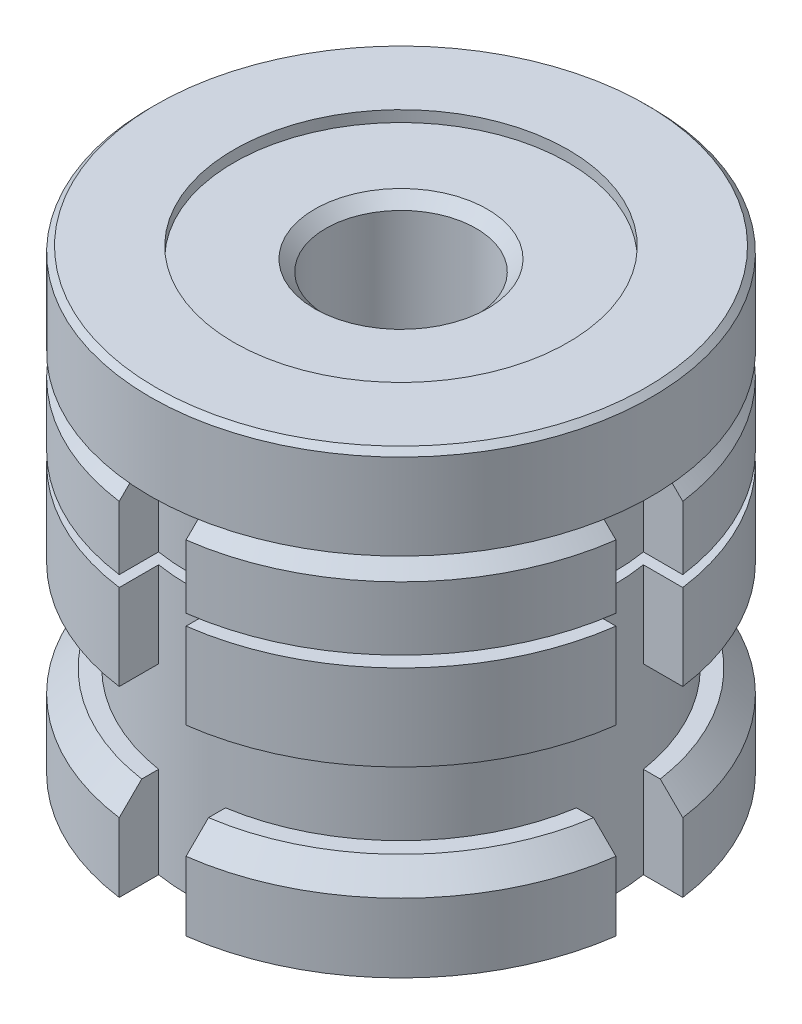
ISO-10303-21;
HEADER;
FILE_DESCRIPTION(('STEP AP214'),'2;1');
FILE_NAME('part.step','',(''),(''),'','','');
FILE_SCHEMA(('AUTOMOTIVE_DESIGN { 1 0 10303 214 1 1 1 1 }'));
ENDSEC;
DATA;
#1=APPLICATION_CONTEXT('core data for automotive mechanical design processes');
#2=APPLICATION_PROTOCOL_DEFINITION('international standard','automotive_design',2000,#1);
#3=PRODUCT_CONTEXT('',#1,'mechanical');
#4=PRODUCT('Part','Part','',(#3));
#5=PRODUCT_RELATED_PRODUCT_CATEGORY('part','',(#4));
#6=PRODUCT_DEFINITION_FORMATION('','',#4);
#7=PRODUCT_DEFINITION_CONTEXT('part definition',#1,'design');
#8=PRODUCT_DEFINITION('design','',#6,#7);
#9=PRODUCT_DEFINITION_SHAPE('','',#8);
#10=(LENGTH_UNIT() NAMED_UNIT(*) SI_UNIT(.MILLI.,.METRE.));
#11=(NAMED_UNIT(*) PLANE_ANGLE_UNIT() SI_UNIT($,.RADIAN.));
#12=(NAMED_UNIT(*) SI_UNIT($,.STERADIAN.) SOLID_ANGLE_UNIT());
#13=UNCERTAINTY_MEASURE_WITH_UNIT(LENGTH_MEASURE(1.E-05),#10,'distance_accuracy_value','');
#14=(GEOMETRIC_REPRESENTATION_CONTEXT(3) GLOBAL_UNCERTAINTY_ASSIGNED_CONTEXT((#13)) GLOBAL_UNIT_ASSIGNED_CONTEXT((#10,
#11,#12)) REPRESENTATION_CONTEXT('',''));
#15=CARTESIAN_POINT('',(0.,0.,0.));
#16=DIRECTION('',(0.,0.,1.));
#17=DIRECTION('',(1.,0.,0.));
#18=AXIS2_PLACEMENT_3D('',#15,#16,#17);
#19=CARTESIAN_POINT('',(0.,16.4,0.));
#20=DIRECTION('',(0.,-1.,0.));
#21=DIRECTION('',(0.,0.,-1.));
#22=AXIS2_PLACEMENT_3D('',#19,#20,#21);
#23=CYLINDRICAL_SURFACE('',#22,22.5);
#24=DIRECTION('',(0.,1.,0.));
#25=VECTOR('',#24,1.);
#26=CARTESIAN_POINT('',(-3.00000000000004,-23.4693113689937,22.2991031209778));
#27=LINE('',#26,#25);
#28=CARTESIAN_POINT('',(-3.00000000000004,8.69999999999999,22.2991031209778));
#29=VERTEX_POINT('',#28);
#30=CARTESIAN_POINT('',(-3.00000000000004,14.4,22.2991031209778));
#31=VERTEX_POINT('',#30);
#32=EDGE_CURVE('E1103',#29,#31,#27,.T.);
#33=ORIENTED_EDGE('',*,*,#32,.T.);
#34=CARTESIAN_POINT('',(0.,14.4,0.));
#35=DIRECTION('',(0.,1.,0.));
#36=DIRECTION('',(0.,0.,1.));
#37=AXIS2_PLACEMENT_3D('',#34,#35,#36);
#38=CIRCLE('',#37,22.5);
#39=CARTESIAN_POINT('',(-22.2991031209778,14.4,3.));
#40=VERTEX_POINT('',#39);
#41=EDGE_CURVE('E55',#31,#40,#38,.F.);
#42=ORIENTED_EDGE('',*,*,#41,.T.);
#43=DIRECTION('',(0.,1.,0.));
#44=VECTOR('',#43,1.);
#45=CARTESIAN_POINT('',(-22.2991031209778,-23.4693113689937,3.));
#46=LINE('',#45,#44);
#47=CARTESIAN_POINT('',(-22.2991031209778,8.69999999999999,3.));
#48=VERTEX_POINT('',#47);
#49=EDGE_CURVE('E867',#48,#40,#46,.T.);
#50=ORIENTED_EDGE('',*,*,#49,.F.);
#51=CARTESIAN_POINT('',(0.,8.7,0.));
#52=DIRECTION('',(0.,1.,0.));
#53=DIRECTION('',(0.,0.,1.));
#54=AXIS2_PLACEMENT_3D('',#51,#52,#53);
#55=CIRCLE('',#54,22.5);
#56=EDGE_CURVE('E589',#48,#29,#55,.T.);
#57=ORIENTED_EDGE('',*,*,#56,.T.);
#58=EDGE_LOOP('',(#33,#42,#50,#57));
#59=FACE_BOUND('',#58,.T.);
#60=ADVANCED_FACE('F39',(#59),#23,.T.);
#61=DIRECTION('',(0.,1.,0.));
#62=VECTOR('',#61,1.);
#63=CARTESIAN_POINT('',(-22.2991031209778,-23.4693113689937,-3.));
#64=LINE('',#63,#62);
#65=CARTESIAN_POINT('',(-22.2991031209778,8.7,-3.));
#66=VERTEX_POINT('',#65);
#67=CARTESIAN_POINT('',(-22.2991031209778,14.4,-3.));
#68=VERTEX_POINT('',#67);
#69=EDGE_CURVE('E882',#66,#68,#64,.T.);
#70=ORIENTED_EDGE('',*,*,#69,.T.);
#71=CARTESIAN_POINT('',(0.,14.4,0.));
#72=DIRECTION('',(0.,1.,0.));
#73=DIRECTION('',(0.,0.,1.));
#74=AXIS2_PLACEMENT_3D('',#71,#72,#73);
#75=CIRCLE('',#74,22.5);
#76=CARTESIAN_POINT('',(-3.00000000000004,14.4,-22.2991031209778));
#77=VERTEX_POINT('',#76);
#78=EDGE_CURVE('E647',#68,#77,#75,.F.);
#79=ORIENTED_EDGE('',*,*,#78,.T.);
#80=DIRECTION('',(0.,1.,0.));
#81=VECTOR('',#80,1.);
#82=CARTESIAN_POINT('',(-3.00000000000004,-23.4693113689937,-22.2991031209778));
#83=LINE('',#82,#81);
#84=CARTESIAN_POINT('',(-3.00000000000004,8.69999999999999,-22.2991031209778));
#85=VERTEX_POINT('',#84);
#86=EDGE_CURVE('E463',#85,#77,#83,.T.);
#87=ORIENTED_EDGE('',*,*,#86,.F.);
#88=EDGE_CURVE('E1228',#85,#66,#55,.T.);
#89=ORIENTED_EDGE('',*,*,#88,.T.);
#90=EDGE_LOOP('',(#70,#79,#87,#89));
#91=FACE_BOUND('',#90,.T.);
#92=ADVANCED_FACE('F1241',(#91),#23,.T.);
#93=DIRECTION('',(0.,1.,0.));
#94=VECTOR('',#93,1.);
#95=CARTESIAN_POINT('',(22.2991031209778,-23.4693113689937,2.9999999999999));
#96=LINE('',#95,#94);
#97=CARTESIAN_POINT('',(22.2991031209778,8.69999999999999,2.9999999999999));
#98=VERTEX_POINT('',#97);
#99=CARTESIAN_POINT('',(22.2991031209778,14.4,2.9999999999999));
#100=VERTEX_POINT('',#99);
#101=EDGE_CURVE('E1016',#98,#100,#96,.T.);
#102=ORIENTED_EDGE('',*,*,#101,.T.);
#103=CARTESIAN_POINT('',(0.,14.4,0.));
#104=DIRECTION('',(0.,1.,0.));
#105=DIRECTION('',(0.,0.,1.));
#106=AXIS2_PLACEMENT_3D('',#103,#104,#105);
#107=CIRCLE('',#106,22.5);
#108=CARTESIAN_POINT('',(3.00000000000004,14.4,22.2991031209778));
#109=VERTEX_POINT('',#108);
#110=EDGE_CURVE('E728',#100,#109,#107,.F.);
#111=ORIENTED_EDGE('',*,*,#110,.T.);
#112=DIRECTION('',(0.,1.,0.));
#113=VECTOR('',#112,1.);
#114=CARTESIAN_POINT('',(3.00000000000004,-23.4693113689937,22.2991031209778));
#115=LINE('',#114,#113);
#116=CARTESIAN_POINT('',(3.00000000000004,8.69999999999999,22.2991031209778));
#117=VERTEX_POINT('',#116);
#118=EDGE_CURVE('E1095',#117,#109,#115,.T.);
#119=ORIENTED_EDGE('',*,*,#118,.F.);
#120=EDGE_CURVE('E590',#117,#98,#55,.T.);
#121=ORIENTED_EDGE('',*,*,#120,.T.);
#122=EDGE_LOOP('',(#102,#111,#119,#121));
#123=FACE_BOUND('',#122,.T.);
#124=ADVANCED_FACE('F1093',(#123),#23,.T.);
#125=CARTESIAN_POINT('',(0.,8.7,22.5));
#126=DIRECTION('',(0.,1.,0.));
#127=DIRECTION('',(0.,0.,1.));
#128=AXIS2_PLACEMENT_3D('',#125,#126,#127);
#129=PLANE('',#128);
#130=CARTESIAN_POINT('',(0.,8.70000000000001,0.));
#131=DIRECTION('',(0.,1.,0.));
#132=DIRECTION('',(0.,0.,1.));
#133=AXIS2_PLACEMENT_3D('',#130,#131,#132);
#134=CIRCLE('',#133,15.);
#135=CARTESIAN_POINT('',(0.,8.70000000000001,15.));
#136=VERTEX_POINT('',#135);
#137=EDGE_CURVE('E594',#136,#136,#134,.T.);
#138=ORIENTED_EDGE('',*,*,#137,.T.);
#139=EDGE_LOOP('',(#138));
#140=FACE_BOUND('',#139,.T.);
#141=ORIENTED_EDGE('',*,*,#56,.F.);
#142=DIRECTION('',(1.,0.,0.));
#143=VECTOR('',#142,1.);
#144=CARTESIAN_POINT('',(0.,8.7,3.));
#145=LINE('',#144,#143);
#146=CARTESIAN_POINT('',(-18.7616630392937,8.69999999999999,3.));
#147=VERTEX_POINT('',#146);
#148=EDGE_CURVE('E564',#48,#147,#145,.T.);
#149=ORIENTED_EDGE('',*,*,#148,.T.);
#150=CARTESIAN_POINT('',(0.,8.7,0.));
#151=DIRECTION('',(0.,1.,0.));
#152=DIRECTION('',(0.,0.,1.));
#153=AXIS2_PLACEMENT_3D('',#150,#151,#152);
#154=CIRCLE('',#153,19.);
#155=CARTESIAN_POINT('',(-18.7616630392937,8.69999999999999,-3.));
#156=VERTEX_POINT('',#155);
#157=EDGE_CURVE('E548',#147,#156,#154,.F.);
#158=ORIENTED_EDGE('',*,*,#157,.T.);
#159=DIRECTION('',(-1.,0.,0.));
#160=VECTOR('',#159,1.);
#161=CARTESIAN_POINT('',(0.,8.7,-3.));
#162=LINE('',#161,#160);
#163=EDGE_CURVE('E541',#156,#66,#162,.T.);
#164=ORIENTED_EDGE('',*,*,#163,.T.);
#165=ORIENTED_EDGE('',*,*,#88,.F.);
#166=DIRECTION('',(0.,0.,1.));
#167=VECTOR('',#166,1.);
#168=CARTESIAN_POINT('',(-3.00000000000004,8.7,22.5));
#169=LINE('',#168,#167);
#170=CARTESIAN_POINT('',(-3.00000000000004,8.69999999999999,-18.7616630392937));
#171=VERTEX_POINT('',#170);
#172=EDGE_CURVE('E527',#85,#171,#169,.T.);
#173=ORIENTED_EDGE('',*,*,#172,.T.);
#174=CARTESIAN_POINT('',(0.,8.7,0.));
#175=DIRECTION('',(0.,1.,0.));
#176=DIRECTION('',(0.,0.,1.));
#177=AXIS2_PLACEMENT_3D('',#174,#175,#176);
#178=CIRCLE('',#177,19.);
#179=CARTESIAN_POINT('',(3.00000000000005,8.69999999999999,-18.7616630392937));
#180=VERTEX_POINT('',#179);
#181=EDGE_CURVE('E422',#171,#180,#178,.F.);
#182=ORIENTED_EDGE('',*,*,#181,.T.);
#183=DIRECTION('',(0.,0.,-1.));
#184=VECTOR('',#183,1.);
#185=CARTESIAN_POINT('',(3.00000000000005,8.7,22.5));
#186=LINE('',#185,#184);
#187=CARTESIAN_POINT('',(3.00000000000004,8.7,-22.2991031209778));
#188=VERTEX_POINT('',#187);
#189=EDGE_CURVE('E500',#180,#188,#186,.T.);
#190=ORIENTED_EDGE('',*,*,#189,.T.);
#191=CARTESIAN_POINT('',(22.2991031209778,8.69999999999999,-3.));
#192=VERTEX_POINT('',#191);
#193=EDGE_CURVE('E595',#192,#188,#55,.T.);
#194=ORIENTED_EDGE('',*,*,#193,.F.);
#195=DIRECTION('',(-1.,0.,0.));
#196=VECTOR('',#195,1.);
#197=CARTESIAN_POINT('',(0.,8.7,-3.));
#198=LINE('',#197,#196);
#199=CARTESIAN_POINT('',(18.7616630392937,8.69999999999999,-3.));
#200=VERTEX_POINT('',#199);
#201=EDGE_CURVE('E1061',#192,#200,#198,.T.);
#202=ORIENTED_EDGE('',*,*,#201,.T.);
#203=CARTESIAN_POINT('',(0.,8.7,0.));
#204=DIRECTION('',(0.,1.,0.));
#205=DIRECTION('',(0.,0.,1.));
#206=AXIS2_PLACEMENT_3D('',#203,#204,#205);
#207=CIRCLE('',#206,19.);
#208=CARTESIAN_POINT('',(18.7616630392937,8.7,2.9999999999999));
#209=VERTEX_POINT('',#208);
#210=EDGE_CURVE('E1059',#200,#209,#207,.F.);
#211=ORIENTED_EDGE('',*,*,#210,.T.);
#212=DIRECTION('',(1.,0.,0.));
#213=VECTOR('',#212,1.);
#214=CARTESIAN_POINT('',(0.,8.7,2.9999999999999));
#215=LINE('',#214,#213);
#216=EDGE_CURVE('E988',#209,#98,#215,.T.);
#217=ORIENTED_EDGE('',*,*,#216,.T.);
#218=ORIENTED_EDGE('',*,*,#120,.F.);
#219=DIRECTION('',(0.,0.,-1.));
#220=VECTOR('',#219,1.);
#221=CARTESIAN_POINT('',(3.00000000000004,8.7,22.5));
#222=LINE('',#221,#220);
#223=CARTESIAN_POINT('',(3.00000000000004,8.69999999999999,18.7616630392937));
#224=VERTEX_POINT('',#223);
#225=EDGE_CURVE('E848',#117,#224,#222,.T.);
#226=ORIENTED_EDGE('',*,*,#225,.T.);
#227=CARTESIAN_POINT('',(0.,8.7,0.));
#228=DIRECTION('',(0.,1.,0.));
#229=DIRECTION('',(0.,0.,1.));
#230=AXIS2_PLACEMENT_3D('',#227,#228,#229);
#231=CIRCLE('',#230,19.);
#232=CARTESIAN_POINT('',(-3.00000000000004,8.7,18.7616630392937));
#233=VERTEX_POINT('',#232);
#234=EDGE_CURVE('E870',#224,#233,#231,.F.);
#235=ORIENTED_EDGE('',*,*,#234,.T.);
#236=DIRECTION('',(0.,0.,1.));
#237=VECTOR('',#236,1.);
#238=CARTESIAN_POINT('',(-3.00000000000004,8.7,22.5));
#239=LINE('',#238,#237);
#240=EDGE_CURVE('E1153',#233,#29,#239,.T.);
#241=ORIENTED_EDGE('',*,*,#240,.T.);
#242=EDGE_LOOP('',(#141,#149,#158,#164,#165,#173,#182,#190,#194,#202,#211,#217,#218,#226,#235,#241));
#243=FACE_BOUND('',#242,.T.);
#244=ADVANCED_FACE('F1065',(#140,#243),#129,.F.);
#245=CARTESIAN_POINT('',(0.,7.7,22.5));
#246=DIRECTION('',(0.,-1.,0.));
#247=DIRECTION('',(0.,0.,-1.));
#248=AXIS2_PLACEMENT_3D('',#245,#246,#247);
#249=PLANE('',#248);
#250=CARTESIAN_POINT('',(0.,7.7,0.));
#251=DIRECTION('',(0.,1.,0.));
#252=DIRECTION('',(0.,0.,1.));
#253=AXIS2_PLACEMENT_3D('',#250,#251,#252);
#254=CIRCLE('',#253,15.);
#255=CARTESIAN_POINT('',(0.,7.7,15.));
#256=VERTEX_POINT('',#255);
#257=EDGE_CURVE('E573',#256,#256,#254,.T.);
#258=ORIENTED_EDGE('',*,*,#257,.F.);
#259=EDGE_LOOP('',(#258));
#260=FACE_BOUND('',#259,.T.);
#261=CARTESIAN_POINT('',(0.,7.7,0.));
#262=DIRECTION('',(0.,-1.,0.));
#263=DIRECTION('',(0.,0.,-1.));
#264=AXIS2_PLACEMENT_3D('',#261,#262,#263);
#265=CIRCLE('',#264,19.);
#266=CARTESIAN_POINT('',(-18.7616630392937,7.69999999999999,-3.));
#267=VERTEX_POINT('',#266);
#268=CARTESIAN_POINT('',(-18.7616630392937,7.69999999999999,3.));
#269=VERTEX_POINT('',#268);
#270=EDGE_CURVE('E545',#267,#269,#265,.F.);
#271=ORIENTED_EDGE('',*,*,#270,.T.);
#272=DIRECTION('',(-1.,0.,0.));
#273=VECTOR('',#272,1.);
#274=CARTESIAN_POINT('',(0.,7.7,3.));
#275=LINE('',#274,#273);
#276=CARTESIAN_POINT('',(-22.2991031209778,7.69999999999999,3.));
#277=VERTEX_POINT('',#276);
#278=EDGE_CURVE('E560',#269,#277,#275,.T.);
#279=ORIENTED_EDGE('',*,*,#278,.T.);
#280=CARTESIAN_POINT('',(0.,7.7,0.));
#281=DIRECTION('',(0.,1.,0.));
#282=DIRECTION('',(0.,0.,1.));
#283=AXIS2_PLACEMENT_3D('',#280,#281,#282);
#284=CIRCLE('',#283,22.5);
#285=CARTESIAN_POINT('',(-3.00000000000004,7.69999999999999,22.2991031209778));
#286=VERTEX_POINT('',#285);
#287=EDGE_CURVE('E584',#277,#286,#284,.T.);
#288=ORIENTED_EDGE('',*,*,#287,.T.);
#289=DIRECTION('',(0.,0.,-1.));
#290=VECTOR('',#289,1.);
#291=CARTESIAN_POINT('',(-3.00000000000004,7.7,22.5));
#292=LINE('',#291,#290);
#293=CARTESIAN_POINT('',(-3.00000000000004,7.69999999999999,18.7616630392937));
#294=VERTEX_POINT('',#293);
#295=EDGE_CURVE('E1148',#286,#294,#292,.T.);
#296=ORIENTED_EDGE('',*,*,#295,.T.);
#297=CARTESIAN_POINT('',(0.,7.7,0.));
#298=DIRECTION('',(0.,-1.,0.));
#299=DIRECTION('',(0.,0.,-1.));
#300=AXIS2_PLACEMENT_3D('',#297,#298,#299);
#301=CIRCLE('',#300,19.);
#302=CARTESIAN_POINT('',(3.00000000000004,7.69999999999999,18.7616630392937));
#303=VERTEX_POINT('',#302);
#304=EDGE_CURVE('E864',#294,#303,#301,.F.);
#305=ORIENTED_EDGE('',*,*,#304,.T.);
#306=DIRECTION('',(0.,0.,1.));
#307=VECTOR('',#306,1.);
#308=CARTESIAN_POINT('',(3.00000000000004,7.7,22.5));
#309=LINE('',#308,#307);
#310=CARTESIAN_POINT('',(3.00000000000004,7.69999999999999,22.2991031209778));
#311=VERTEX_POINT('',#310);
#312=EDGE_CURVE('E1145',#303,#311,#309,.T.);
#313=ORIENTED_EDGE('',*,*,#312,.T.);
#314=CARTESIAN_POINT('',(22.2991031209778,7.69999999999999,2.9999999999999));
#315=VERTEX_POINT('',#314);
#316=EDGE_CURVE('E585',#311,#315,#284,.T.);
#317=ORIENTED_EDGE('',*,*,#316,.T.);
#318=DIRECTION('',(-1.,0.,0.));
#319=VECTOR('',#318,1.);
#320=CARTESIAN_POINT('',(0.,7.7,2.9999999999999));
#321=LINE('',#320,#319);
#322=CARTESIAN_POINT('',(18.7616630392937,7.69999999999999,2.9999999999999));
#323=VERTEX_POINT('',#322);
#324=EDGE_CURVE('E1082',#315,#323,#321,.T.);
#325=ORIENTED_EDGE('',*,*,#324,.T.);
#326=CARTESIAN_POINT('',(0.,7.7,0.));
#327=DIRECTION('',(0.,-1.,0.));
#328=DIRECTION('',(0.,0.,-1.));
#329=AXIS2_PLACEMENT_3D('',#326,#327,#328);
#330=CIRCLE('',#329,19.);
#331=CARTESIAN_POINT('',(18.7616630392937,7.69999999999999,-3.));
#332=VERTEX_POINT('',#331);
#333=EDGE_CURVE('E1158',#323,#332,#330,.F.);
#334=ORIENTED_EDGE('',*,*,#333,.T.);
#335=DIRECTION('',(1.,0.,0.));
#336=VECTOR('',#335,1.);
#337=CARTESIAN_POINT('',(0.,7.7,-3.));
#338=LINE('',#337,#336);
#339=CARTESIAN_POINT('',(22.2991031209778,7.69999999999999,-3.));
#340=VERTEX_POINT('',#339);
#341=EDGE_CURVE('E1070',#332,#340,#338,.T.);
#342=ORIENTED_EDGE('',*,*,#341,.T.);
#343=CARTESIAN_POINT('',(3.00000000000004,7.7,-22.2991031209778));
#344=VERTEX_POINT('',#343);
#345=EDGE_CURVE('E498',#340,#344,#284,.T.);
#346=ORIENTED_EDGE('',*,*,#345,.T.);
#347=DIRECTION('',(0.,0.,1.));
#348=VECTOR('',#347,1.);
#349=CARTESIAN_POINT('',(3.00000000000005,7.7,22.5));
#350=LINE('',#349,#348);
#351=CARTESIAN_POINT('',(3.00000000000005,7.69999999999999,-18.7616630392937));
#352=VERTEX_POINT('',#351);
#353=EDGE_CURVE('E482',#344,#352,#350,.T.);
#354=ORIENTED_EDGE('',*,*,#353,.T.);
#355=CARTESIAN_POINT('',(0.,7.7,0.));
#356=DIRECTION('',(0.,-1.,0.));
#357=DIRECTION('',(0.,0.,-1.));
#358=AXIS2_PLACEMENT_3D('',#355,#356,#357);
#359=CIRCLE('',#358,19.);
#360=CARTESIAN_POINT('',(-3.00000000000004,7.69999999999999,-18.7616630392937));
#361=VERTEX_POINT('',#360);
#362=EDGE_CURVE('E495',#352,#361,#359,.F.);
#363=ORIENTED_EDGE('',*,*,#362,.T.);
#364=DIRECTION('',(0.,0.,-1.));
#365=VECTOR('',#364,1.);
#366=CARTESIAN_POINT('',(-3.00000000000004,7.7,22.5));
#367=LINE('',#366,#365);
#368=CARTESIAN_POINT('',(-3.00000000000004,7.69999999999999,-22.2991031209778));
#369=VERTEX_POINT('',#368);
#370=EDGE_CURVE('E524',#361,#369,#367,.T.);
#371=ORIENTED_EDGE('',*,*,#370,.T.);
#372=CARTESIAN_POINT('',(-22.2991031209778,7.7,-3.));
#373=VERTEX_POINT('',#372);
#374=EDGE_CURVE('E1923',#369,#373,#284,.T.);
#375=ORIENTED_EDGE('',*,*,#374,.T.);
#376=DIRECTION('',(1.,0.,0.));
#377=VECTOR('',#376,1.);
#378=CARTESIAN_POINT('',(0.,7.7,-3.));
#379=LINE('',#378,#377);
#380=EDGE_CURVE('E537',#373,#267,#379,.T.);
#381=ORIENTED_EDGE('',*,*,#380,.T.);
#382=EDGE_LOOP('',(#271,#279,#288,#296,#305,#313,#317,#325,#334,#342,#346,#354,#363,#371,#375,#381));
#383=FACE_BOUND('',#382,.T.);
#384=ADVANCED_FACE('F493',(#260,#383),#249,.F.);
#385=CARTESIAN_POINT('',(0.,0.,0.));
#386=DIRECTION('',(0.,1.,0.));
#387=DIRECTION('',(0.,0.,1.));
#388=AXIS2_PLACEMENT_3D('',#385,#386,#387);
#389=PLANE('',#388);
#390=CARTESIAN_POINT('',(0.,0.,0.));
#391=DIRECTION('',(0.,1.,0.));
#392=DIRECTION('',(0.,0.,1.));
#393=AXIS2_PLACEMENT_3D('',#390,#391,#392);
#394=CIRCLE('',#393,22.5);
#395=CARTESIAN_POINT('',(-22.2991031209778,0.,3.));
#396=VERTEX_POINT('',#395);
#397=CARTESIAN_POINT('',(-3.00000000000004,0.,22.2991031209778));
#398=VERTEX_POINT('',#397);
#399=EDGE_CURVE('E599',#396,#398,#394,.T.);
#400=ORIENTED_EDGE('',*,*,#399,.F.);
#401=DIRECTION('',(1.,0.,0.));
#402=VECTOR('',#401,1.);
#403=CARTESIAN_POINT('',(0.,0.,3.));
#404=LINE('',#403,#402);
#405=CARTESIAN_POINT('',(-18.7616630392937,0.,3.));
#406=VERTEX_POINT('',#405);
#407=EDGE_CURVE('E556',#396,#406,#404,.T.);
#408=ORIENTED_EDGE('',*,*,#407,.T.);
#409=CARTESIAN_POINT('',(0.,0.,0.));
#410=DIRECTION('',(0.,-1.,0.));
#411=DIRECTION('',(0.,0.,-1.));
#412=AXIS2_PLACEMENT_3D('',#409,#410,#411);
#413=CIRCLE('',#412,19.);
#414=CARTESIAN_POINT('',(-3.00000000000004,0.,18.7616630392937));
#415=VERTEX_POINT('',#414);
#416=EDGE_CURVE('E1292',#415,#406,#413,.T.);
#417=ORIENTED_EDGE('',*,*,#416,.F.);
#418=DIRECTION('',(0.,0.,1.));
#419=VECTOR('',#418,1.);
#420=CARTESIAN_POINT('',(-3.00000000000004,0.,0.));
#421=LINE('',#420,#419);
#422=EDGE_CURVE('E847',#415,#398,#421,.T.);
#423=ORIENTED_EDGE('',*,*,#422,.T.);
#424=EDGE_LOOP('',(#400,#408,#417,#423));
#425=FACE_BOUND('',#424,.T.);
#426=ADVANCED_FACE('F1256',(#425),#389,.F.);
#427=CARTESIAN_POINT('',(-18.7616630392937,0.,-3.));
#428=VERTEX_POINT('',#427);
#429=CARTESIAN_POINT('',(-3.00000000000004,0.,-18.7616630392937));
#430=VERTEX_POINT('',#429);
#431=EDGE_CURVE('E580',#428,#430,#413,.T.);
#432=ORIENTED_EDGE('',*,*,#431,.F.);
#433=DIRECTION('',(-1.,0.,0.));
#434=VECTOR('',#433,1.);
#435=CARTESIAN_POINT('',(0.,0.,-3.));
#436=LINE('',#435,#434);
#437=CARTESIAN_POINT('',(-22.2991031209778,0.,-3.));
#438=VERTEX_POINT('',#437);
#439=EDGE_CURVE('E533',#428,#438,#436,.T.);
#440=ORIENTED_EDGE('',*,*,#439,.T.);
#441=CARTESIAN_POINT('',(-3.00000000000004,0.,-22.2991031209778));
#442=VERTEX_POINT('',#441);
#443=EDGE_CURVE('E1282',#442,#438,#394,.T.);
#444=ORIENTED_EDGE('',*,*,#443,.F.);
#445=DIRECTION('',(0.,0.,1.));
#446=VECTOR('',#445,1.);
#447=CARTESIAN_POINT('',(-3.00000000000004,0.,0.));
#448=LINE('',#447,#446);
#449=EDGE_CURVE('E520',#442,#430,#448,.T.);
#450=ORIENTED_EDGE('',*,*,#449,.T.);
#451=EDGE_LOOP('',(#432,#440,#444,#450));
#452=FACE_BOUND('',#451,.T.);
#453=ADVANCED_FACE('F1830',(#452),#389,.F.);
#454=CARTESIAN_POINT('',(18.7616630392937,0.,2.9999999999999));
#455=VERTEX_POINT('',#454);
#456=CARTESIAN_POINT('',(3.00000000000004,0.,18.7616630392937));
#457=VERTEX_POINT('',#456);
#458=EDGE_CURVE('E579',#455,#457,#413,.T.);
#459=ORIENTED_EDGE('',*,*,#458,.F.);
#460=DIRECTION('',(1.,0.,0.));
#461=VECTOR('',#460,1.);
#462=CARTESIAN_POINT('',(0.,0.,2.9999999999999));
#463=LINE('',#462,#461);
#464=CARTESIAN_POINT('',(22.2991031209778,0.,2.9999999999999));
#465=VERTEX_POINT('',#464);
#466=EDGE_CURVE('E1072',#455,#465,#463,.T.);
#467=ORIENTED_EDGE('',*,*,#466,.T.);
#468=CARTESIAN_POINT('',(3.00000000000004,0.,22.2991031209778));
#469=VERTEX_POINT('',#468);
#470=EDGE_CURVE('E600',#469,#465,#394,.T.);
#471=ORIENTED_EDGE('',*,*,#470,.F.);
#472=DIRECTION('',(0.,0.,-1.));
#473=VECTOR('',#472,1.);
#474=CARTESIAN_POINT('',(3.00000000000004,0.,0.));
#475=LINE('',#474,#473);
#476=EDGE_CURVE('E1188',#469,#457,#475,.T.);
#477=ORIENTED_EDGE('',*,*,#476,.T.);
#478=EDGE_LOOP('',(#459,#467,#471,#477));
#479=FACE_BOUND('',#478,.T.);
#480=ADVANCED_FACE('F1187',(#479),#389,.F.);
#481=ORIENTED_EDGE('',*,*,#287,.F.);
#482=EDGE_CURVE('E865',#396,#277,#46,.T.);
#483=ORIENTED_EDGE('',*,*,#482,.F.);
#484=ORIENTED_EDGE('',*,*,#399,.T.);
#485=EDGE_CURVE('E1101',#398,#286,#27,.T.);
#486=ORIENTED_EDGE('',*,*,#485,.T.);
#487=EDGE_LOOP('',(#481,#483,#484,#486));
#488=FACE_BOUND('',#487,.T.);
#489=ADVANCED_FACE('F1273',(#488),#23,.T.);
#490=ORIENTED_EDGE('',*,*,#443,.T.);
#491=EDGE_CURVE('E880',#438,#373,#64,.T.);
#492=ORIENTED_EDGE('',*,*,#491,.T.);
#493=ORIENTED_EDGE('',*,*,#374,.F.);
#494=EDGE_CURVE('E951',#442,#369,#83,.T.);
#495=ORIENTED_EDGE('',*,*,#494,.F.);
#496=EDGE_LOOP('',(#490,#492,#493,#495));
#497=FACE_BOUND('',#496,.T.);
#498=ADVANCED_FACE('F1267',(#497),#23,.T.);
#499=ORIENTED_EDGE('',*,*,#470,.T.);
#500=EDGE_CURVE('E1015',#465,#315,#96,.T.);
#501=ORIENTED_EDGE('',*,*,#500,.T.);
#502=ORIENTED_EDGE('',*,*,#316,.F.);
#503=EDGE_CURVE('E1098',#469,#311,#115,.T.);
#504=ORIENTED_EDGE('',*,*,#503,.F.);
#505=EDGE_LOOP('',(#499,#501,#502,#504));
#506=FACE_BOUND('',#505,.T.);
#507=ADVANCED_FACE('F1183',(#506),#23,.T.);
#508=CARTESIAN_POINT('',(0.,-8.2,0.));
#509=DIRECTION('',(0.,-1.,0.));
#510=DIRECTION('',(0.,0.,-1.));
#511=AXIS2_PLACEMENT_3D('',#508,#509,#510);
#512=CYLINDRICAL_SURFACE('',#511,22.5);
#513=CARTESIAN_POINT('',(-3.00000000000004,-16.4,22.2991031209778));
#514=VERTEX_POINT('',#513);
#515=CARTESIAN_POINT('',(-3.00000000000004,-10.2,22.2991031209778));
#516=VERTEX_POINT('',#515);
#517=EDGE_CURVE('E858',#514,#516,#27,.T.);
#518=ORIENTED_EDGE('',*,*,#517,.T.);
#519=CARTESIAN_POINT('',(0.,-10.2,0.));
#520=DIRECTION('',(0.,-1.,0.));
#521=DIRECTION('',(0.,0.,-1.));
#522=AXIS2_PLACEMENT_3D('',#519,#520,#521);
#523=CIRCLE('',#522,22.5);
#524=CARTESIAN_POINT('',(-22.2991031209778,-10.2,3.));
#525=VERTEX_POINT('',#524);
#526=EDGE_CURVE('E775',#516,#525,#523,.T.);
#527=ORIENTED_EDGE('',*,*,#526,.T.);
#528=CARTESIAN_POINT('',(-22.2991031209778,-16.4,3.));
#529=VERTEX_POINT('',#528);
#530=EDGE_CURVE('E856',#529,#525,#46,.T.);
#531=ORIENTED_EDGE('',*,*,#530,.F.);
#532=CARTESIAN_POINT('',(0.,-16.4,0.));
#533=DIRECTION('',(0.,-1.,0.));
#534=DIRECTION('',(0.,0.,-1.));
#535=AXIS2_PLACEMENT_3D('',#532,#533,#534);
#536=CIRCLE('',#535,22.5);
#537=EDGE_CURVE('E1932',#514,#529,#536,.T.);
#538=ORIENTED_EDGE('',*,*,#537,.F.);
#539=EDGE_LOOP('',(#518,#527,#531,#538));
#540=FACE_BOUND('',#539,.T.);
#541=ADVANCED_FACE('F854',(#540),#512,.T.);
#542=CARTESIAN_POINT('',(-22.2991031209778,-16.4,-3.));
#543=VERTEX_POINT('',#542);
#544=CARTESIAN_POINT('',(-22.2991031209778,-10.2,-3.));
#545=VERTEX_POINT('',#544);
#546=EDGE_CURVE('E876',#543,#545,#64,.T.);
#547=ORIENTED_EDGE('',*,*,#546,.T.);
#548=CARTESIAN_POINT('',(0.,-10.2,0.));
#549=DIRECTION('',(0.,-1.,0.));
#550=DIRECTION('',(0.,0.,-1.));
#551=AXIS2_PLACEMENT_3D('',#548,#549,#550);
#552=CIRCLE('',#551,22.5);
#553=CARTESIAN_POINT('',(-3.00000000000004,-10.2,-22.2991031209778));
#554=VERTEX_POINT('',#553);
#555=EDGE_CURVE('E609',#545,#554,#552,.T.);
#556=ORIENTED_EDGE('',*,*,#555,.T.);
#557=CARTESIAN_POINT('',(-3.00000000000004,-16.4,-22.2991031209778));
#558=VERTEX_POINT('',#557);
#559=EDGE_CURVE('E948',#558,#554,#83,.T.);
#560=ORIENTED_EDGE('',*,*,#559,.F.);
#561=EDGE_CURVE('E568',#543,#558,#536,.T.);
#562=ORIENTED_EDGE('',*,*,#561,.F.);
#563=EDGE_LOOP('',(#547,#556,#560,#562));
#564=FACE_BOUND('',#563,.T.);
#565=ADVANCED_FACE('F1272',(#564),#512,.T.);
#566=CARTESIAN_POINT('',(22.2991031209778,-16.4,2.9999999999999));
#567=VERTEX_POINT('',#566);
#568=CARTESIAN_POINT('',(22.2991031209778,-10.2,2.9999999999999));
#569=VERTEX_POINT('',#568);
#570=EDGE_CURVE('E1010',#567,#569,#96,.T.);
#571=ORIENTED_EDGE('',*,*,#570,.T.);
#572=CARTESIAN_POINT('',(0.,-10.2,0.));
#573=DIRECTION('',(0.,-1.,0.));
#574=DIRECTION('',(0.,0.,-1.));
#575=AXIS2_PLACEMENT_3D('',#572,#573,#574);
#576=CIRCLE('',#575,22.5);
#577=CARTESIAN_POINT('',(3.00000000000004,-10.2,22.2991031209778));
#578=VERTEX_POINT('',#577);
#579=EDGE_CURVE('E746',#569,#578,#576,.T.);
#580=ORIENTED_EDGE('',*,*,#579,.T.);
#581=CARTESIAN_POINT('',(3.00000000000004,-16.4,22.2991031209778));
#582=VERTEX_POINT('',#581);
#583=EDGE_CURVE('E1100',#582,#578,#115,.T.);
#584=ORIENTED_EDGE('',*,*,#583,.F.);
#585=EDGE_CURVE('E574',#567,#582,#536,.T.);
#586=ORIENTED_EDGE('',*,*,#585,.F.);
#587=EDGE_LOOP('',(#571,#580,#584,#586));
#588=FACE_BOUND('',#587,.T.);
#589=ADVANCED_FACE('F1254',(#588),#512,.T.);
#590=CARTESIAN_POINT('',(0.,-8.2,0.));
#591=DIRECTION('',(0.,-1.,0.));
#592=DIRECTION('',(0.,0.,-1.));
#593=AXIS2_PLACEMENT_3D('',#590,#591,#592);
#594=PLANE('',#593);
#595=DIRECTION('',(-1.,0.,0.));
#596=VECTOR('',#595,1.);
#597=CARTESIAN_POINT('',(0.,-8.2,3.));
#598=LINE('',#597,#596);
#599=CARTESIAN_POINT('',(-18.7616630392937,-8.2,3.));
#600=VERTEX_POINT('',#599);
#601=CARTESIAN_POINT('',(-20.2792997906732,-8.2,3.));
#602=VERTEX_POINT('',#601);
#603=EDGE_CURVE('E552',#600,#602,#598,.T.);
#604=ORIENTED_EDGE('',*,*,#603,.T.);
#605=CARTESIAN_POINT('',(0.,-8.2,0.));
#606=DIRECTION('',(0.,-1.,0.));
#607=DIRECTION('',(0.,0.,-1.));
#608=AXIS2_PLACEMENT_3D('',#605,#606,#607);
#609=CIRCLE('',#608,20.5);
#610=CARTESIAN_POINT('',(-3.00000000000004,-8.2,20.2792997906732));
#611=VERTEX_POINT('',#610);
#612=EDGE_CURVE('E785',#602,#611,#609,.F.);
#613=ORIENTED_EDGE('',*,*,#612,.T.);
#614=DIRECTION('',(0.,0.,-1.));
#615=VECTOR('',#614,1.);
#616=CARTESIAN_POINT('',(-3.00000000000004,-8.2,0.));
#617=LINE('',#616,#615);
#618=CARTESIAN_POINT('',(-3.00000000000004,-8.2,18.7616630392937));
#619=VERTEX_POINT('',#618);
#620=EDGE_CURVE('E839',#611,#619,#617,.T.);
#621=ORIENTED_EDGE('',*,*,#620,.T.);
#622=CARTESIAN_POINT('',(0.,-8.2,0.));
#623=DIRECTION('',(0.,-1.,0.));
#624=DIRECTION('',(0.,0.,-1.));
#625=AXIS2_PLACEMENT_3D('',#622,#623,#624);
#626=CIRCLE('',#625,19.);
#627=EDGE_CURVE('E1927',#619,#600,#626,.T.);
#628=ORIENTED_EDGE('',*,*,#627,.T.);
#629=EDGE_LOOP('',(#604,#613,#621,#628));
#630=FACE_BOUND('',#629,.T.);
#631=ADVANCED_FACE('F837',(#630),#594,.F.);
#632=DIRECTION('',(0.,0.,-1.));
#633=VECTOR('',#632,1.);
#634=CARTESIAN_POINT('',(-3.00000000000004,-8.2,0.));
#635=LINE('',#634,#633);
#636=CARTESIAN_POINT('',(-3.00000000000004,-8.2,-18.7616630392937));
#637=VERTEX_POINT('',#636);
#638=CARTESIAN_POINT('',(-3.00000000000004,-8.2,-20.2792997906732));
#639=VERTEX_POINT('',#638);
#640=EDGE_CURVE('E516',#637,#639,#635,.T.);
#641=ORIENTED_EDGE('',*,*,#640,.T.);
#642=CARTESIAN_POINT('',(0.,-8.2,0.));
#643=DIRECTION('',(0.,-1.,0.));
#644=DIRECTION('',(0.,0.,-1.));
#645=AXIS2_PLACEMENT_3D('',#642,#643,#644);
#646=CIRCLE('',#645,20.5);
#647=CARTESIAN_POINT('',(-20.2792997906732,-8.2,-3.));
#648=VERTEX_POINT('',#647);
#649=EDGE_CURVE('E622',#639,#648,#646,.F.);
#650=ORIENTED_EDGE('',*,*,#649,.T.);
#651=DIRECTION('',(1.,0.,0.));
#652=VECTOR('',#651,1.);
#653=CARTESIAN_POINT('',(0.,-8.2,-3.));
#654=LINE('',#653,#652);
#655=CARTESIAN_POINT('',(-18.7616630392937,-8.2,-3.));
#656=VERTEX_POINT('',#655);
#657=EDGE_CURVE('E530',#648,#656,#654,.T.);
#658=ORIENTED_EDGE('',*,*,#657,.T.);
#659=EDGE_CURVE('E578',#656,#637,#626,.T.);
#660=ORIENTED_EDGE('',*,*,#659,.T.);
#661=EDGE_LOOP('',(#641,#650,#658,#660));
#662=FACE_BOUND('',#661,.T.);
#663=ADVANCED_FACE('F1773',(#662),#594,.F.);
#664=DIRECTION('',(0.,0.,1.));
#665=VECTOR('',#664,1.);
#666=CARTESIAN_POINT('',(3.00000000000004,-8.2,0.));
#667=LINE('',#666,#665);
#668=CARTESIAN_POINT('',(3.00000000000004,-8.2,18.7616630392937));
#669=VERTEX_POINT('',#668);
#670=CARTESIAN_POINT('',(3.00000000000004,-8.2,20.2792997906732));
#671=VERTEX_POINT('',#670);
#672=EDGE_CURVE('E1216',#669,#671,#667,.T.);
#673=ORIENTED_EDGE('',*,*,#672,.T.);
#674=CARTESIAN_POINT('',(0.,-8.2,0.));
#675=DIRECTION('',(0.,-1.,0.));
#676=DIRECTION('',(0.,0.,-1.));
#677=AXIS2_PLACEMENT_3D('',#674,#675,#676);
#678=CIRCLE('',#677,20.5);
#679=CARTESIAN_POINT('',(20.2792997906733,-8.2,2.9999999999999));
#680=VERTEX_POINT('',#679);
#681=EDGE_CURVE('E766',#671,#680,#678,.F.);
#682=ORIENTED_EDGE('',*,*,#681,.T.);
#683=DIRECTION('',(-1.,0.,0.));
#684=VECTOR('',#683,1.);
#685=CARTESIAN_POINT('',(0.,-8.2,2.9999999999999));
#686=LINE('',#685,#684);
#687=CARTESIAN_POINT('',(18.7616630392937,-8.2,2.9999999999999));
#688=VERTEX_POINT('',#687);
#689=EDGE_CURVE('E1069',#680,#688,#686,.T.);
#690=ORIENTED_EDGE('',*,*,#689,.T.);
#691=EDGE_CURVE('E610',#688,#669,#626,.T.);
#692=ORIENTED_EDGE('',*,*,#691,.T.);
#693=EDGE_LOOP('',(#673,#682,#690,#692));
#694=FACE_BOUND('',#693,.T.);
#695=ADVANCED_FACE('F1714',(#694),#594,.F.);
#696=CARTESIAN_POINT('',(0.,-16.4,0.));
#697=DIRECTION('',(0.,-1.,0.));
#698=DIRECTION('',(0.,0.,-1.));
#699=AXIS2_PLACEMENT_3D('',#696,#697,#698);
#700=PLANE('',#699);
#701=CARTESIAN_POINT('',(0.,-16.4,0.));
#702=DIRECTION('',(0.,-1.,0.));
#703=DIRECTION('',(0.,0.,-1.));
#704=AXIS2_PLACEMENT_3D('',#701,#702,#703);
#705=CIRCLE('',#704,7.75);
#706=CARTESIAN_POINT('',(0.,-16.4,-7.75));
#707=VERTEX_POINT('',#706);
#708=EDGE_CURVE('E1348',#707,#707,#705,.F.);
#709=ORIENTED_EDGE('',*,*,#708,.T.);
#710=EDGE_LOOP('',(#709));
#711=FACE_BOUND('',#710,.T.);
#712=DIRECTION('',(1.,0.,0.));
#713=VECTOR('',#712,1.);
#714=CARTESIAN_POINT('',(-18.7616630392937,-16.4,3.));
#715=LINE('',#714,#713);
#716=CARTESIAN_POINT('',(-18.7616630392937,-16.4,3.));
#717=VERTEX_POINT('',#716);
#718=EDGE_CURVE('E862',#529,#717,#715,.T.);
#719=ORIENTED_EDGE('',*,*,#718,.T.);
#720=CARTESIAN_POINT('',(0.,-16.4,0.));
#721=DIRECTION('',(0.,-1.,0.));
#722=DIRECTION('',(0.,0.,-1.));
#723=AXIS2_PLACEMENT_3D('',#720,#721,#722);
#724=CIRCLE('',#723,19.);
#725=CARTESIAN_POINT('',(-18.7616630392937,-16.4,-3.));
#726=VERTEX_POINT('',#725);
#727=EDGE_CURVE('E913',#717,#726,#724,.T.);
#728=ORIENTED_EDGE('',*,*,#727,.T.);
#729=DIRECTION('',(-1.,0.,0.));
#730=VECTOR('',#729,1.);
#731=CARTESIAN_POINT('',(-22.2991031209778,-16.4,-3.));
#732=LINE('',#731,#730);
#733=EDGE_CURVE('E893',#726,#543,#732,.T.);
#734=ORIENTED_EDGE('',*,*,#733,.T.);
#735=ORIENTED_EDGE('',*,*,#561,.T.);
#736=DIRECTION('',(0.,0.,1.));
#737=VECTOR('',#736,1.);
#738=CARTESIAN_POINT('',(-3.00000000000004,-16.4,-22.2991031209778));
#739=LINE('',#738,#737);
#740=CARTESIAN_POINT('',(-3.00000000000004,-16.4,-18.7616630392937));
#741=VERTEX_POINT('',#740);
#742=EDGE_CURVE('E425',#558,#741,#739,.T.);
#743=ORIENTED_EDGE('',*,*,#742,.T.);
#744=CARTESIAN_POINT('',(0.,-16.4,0.));
#745=DIRECTION('',(0.,-1.,0.));
#746=DIRECTION('',(0.,0.,-1.));
#747=AXIS2_PLACEMENT_3D('',#744,#745,#746);
#748=CIRCLE('',#747,19.);
#749=CARTESIAN_POINT('',(3.00000000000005,-16.4,-18.7616630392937));
#750=VERTEX_POINT('',#749);
#751=EDGE_CURVE('E439',#741,#750,#748,.T.);
#752=ORIENTED_EDGE('',*,*,#751,.T.);
#753=DIRECTION('',(0.,0.,-1.));
#754=VECTOR('',#753,1.);
#755=CARTESIAN_POINT('',(3.00000000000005,-16.4,-18.7616630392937));
#756=LINE('',#755,#754);
#757=CARTESIAN_POINT('',(3.00000000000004,-16.4,-22.2991031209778));
#758=VERTEX_POINT('',#757);
#759=EDGE_CURVE('E459',#750,#758,#756,.T.);
#760=ORIENTED_EDGE('',*,*,#759,.T.);
#761=CARTESIAN_POINT('',(22.2991031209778,-16.4,-3.));
#762=VERTEX_POINT('',#761);
#763=EDGE_CURVE('E569',#758,#762,#536,.T.);
#764=ORIENTED_EDGE('',*,*,#763,.T.);
#765=DIRECTION('',(-1.,0.,0.));
#766=VECTOR('',#765,1.);
#767=CARTESIAN_POINT('',(18.7616630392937,-16.4,-3.));
#768=LINE('',#767,#766);
#769=CARTESIAN_POINT('',(18.7616630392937,-16.4,-3.));
#770=VERTEX_POINT('',#769);
#771=EDGE_CURVE('E999',#762,#770,#768,.T.);
#772=ORIENTED_EDGE('',*,*,#771,.T.);
#773=CARTESIAN_POINT('',(0.,-16.4,0.));
#774=DIRECTION('',(0.,-1.,0.));
#775=DIRECTION('',(0.,0.,-1.));
#776=AXIS2_PLACEMENT_3D('',#773,#774,#775);
#777=CIRCLE('',#776,19.);
#778=CARTESIAN_POINT('',(18.7616630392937,-16.4,2.9999999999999));
#779=VERTEX_POINT('',#778);
#780=EDGE_CURVE('E1044',#770,#779,#777,.T.);
#781=ORIENTED_EDGE('',*,*,#780,.T.);
#782=DIRECTION('',(1.,0.,0.));
#783=VECTOR('',#782,1.);
#784=CARTESIAN_POINT('',(22.2991031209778,-16.4,2.9999999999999));
#785=LINE('',#784,#783);
#786=EDGE_CURVE('E1026',#779,#567,#785,.T.);
#787=ORIENTED_EDGE('',*,*,#786,.T.);
#788=ORIENTED_EDGE('',*,*,#585,.T.);
#789=DIRECTION('',(0.,0.,-1.));
#790=VECTOR('',#789,1.);
#791=CARTESIAN_POINT('',(3.00000000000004,-16.4,22.2991031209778));
#792=LINE('',#791,#790);
#793=CARTESIAN_POINT('',(3.00000000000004,-16.4,18.7616630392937));
#794=VERTEX_POINT('',#793);
#795=EDGE_CURVE('E1107',#582,#794,#792,.T.);
#796=ORIENTED_EDGE('',*,*,#795,.T.);
#797=CARTESIAN_POINT('',(0.,-16.4,0.));
#798=DIRECTION('',(0.,-1.,0.));
#799=DIRECTION('',(0.,0.,-1.));
#800=AXIS2_PLACEMENT_3D('',#797,#798,#799);
#801=CIRCLE('',#800,19.);
#802=CARTESIAN_POINT('',(-3.00000000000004,-16.4,18.7616630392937));
#803=VERTEX_POINT('',#802);
#804=EDGE_CURVE('E1121',#794,#803,#801,.T.);
#805=ORIENTED_EDGE('',*,*,#804,.T.);
#806=DIRECTION('',(0.,0.,1.));
#807=VECTOR('',#806,1.);
#808=CARTESIAN_POINT('',(-3.00000000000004,-16.4,18.7616630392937));
#809=LINE('',#808,#807);
#810=EDGE_CURVE('E1197',#803,#514,#809,.T.);
#811=ORIENTED_EDGE('',*,*,#810,.T.);
#812=ORIENTED_EDGE('',*,*,#537,.T.);
#813=EDGE_LOOP('',(#719,#728,#734,#735,#743,#752,#760,#764,#772,#781,#787,#788,#796,#805,#811,#812));
#814=FACE_BOUND('',#813,.T.);
#815=ADVANCED_FACE('F1264',(#711,#814),#700,.T.);
#816=CARTESIAN_POINT('',(0.,-16.4,0.));
#817=DIRECTION('',(0.,1.,0.));
#818=DIRECTION('',(0.,0.,1.));
#819=AXIS2_PLACEMENT_3D('',#816,#817,#818);
#820=CYLINDRICAL_SURFACE('',#819,19.);
#821=DIRECTION('',(0.,1.,0.));
#822=VECTOR('',#821,1.);
#823=CARTESIAN_POINT('',(-18.7616630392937,-23.4693113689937,3.));
#824=LINE('',#823,#822);
#825=EDGE_CURVE('E914',#717,#600,#824,.T.);
#826=ORIENTED_EDGE('',*,*,#825,.T.);
#827=ORIENTED_EDGE('',*,*,#627,.F.);
#828=DIRECTION('',(0.,1.,0.));
#829=VECTOR('',#828,1.);
#830=CARTESIAN_POINT('',(-3.00000000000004,-23.4693113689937,18.7616630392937));
#831=LINE('',#830,#829);
#832=EDGE_CURVE('E844',#803,#619,#831,.T.);
#833=ORIENTED_EDGE('',*,*,#832,.F.);
#834=ORIENTED_EDGE('',*,*,#804,.F.);
#835=DIRECTION('',(0.,1.,0.));
#836=VECTOR('',#835,1.);
#837=CARTESIAN_POINT('',(3.00000000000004,-23.4693113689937,18.7616630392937));
#838=LINE('',#837,#836);
#839=EDGE_CURVE('E1119',#794,#669,#838,.T.);
#840=ORIENTED_EDGE('',*,*,#839,.T.);
#841=ORIENTED_EDGE('',*,*,#691,.F.);
#842=DIRECTION('',(0.,1.,0.));
#843=VECTOR('',#842,1.);
#844=CARTESIAN_POINT('',(18.7616630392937,-23.4693113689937,2.9999999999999));
#845=LINE('',#844,#843);
#846=EDGE_CURVE('E418',#779,#688,#845,.T.);
#847=ORIENTED_EDGE('',*,*,#846,.F.);
#848=ORIENTED_EDGE('',*,*,#780,.F.);
#849=DIRECTION('',(0.,1.,0.));
#850=VECTOR('',#849,1.);
#851=CARTESIAN_POINT('',(18.7616630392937,-23.4693113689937,-3.));
#852=LINE('',#851,#850);
#853=CARTESIAN_POINT('',(18.7616630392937,-8.2,-3.));
#854=VERTEX_POINT('',#853);
#855=EDGE_CURVE('E1047',#770,#854,#852,.T.);
#856=ORIENTED_EDGE('',*,*,#855,.T.);
#857=CARTESIAN_POINT('',(3.00000000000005,-8.2,-18.7616630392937));
#858=VERTEX_POINT('',#857);
#859=EDGE_CURVE('E605',#858,#854,#626,.T.);
#860=ORIENTED_EDGE('',*,*,#859,.F.);
#861=DIRECTION('',(0.,1.,0.));
#862=VECTOR('',#861,1.);
#863=CARTESIAN_POINT('',(3.00000000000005,-23.4693113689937,-18.7616630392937));
#864=LINE('',#863,#862);
#865=EDGE_CURVE('E456',#750,#858,#864,.T.);
#866=ORIENTED_EDGE('',*,*,#865,.F.);
#867=ORIENTED_EDGE('',*,*,#751,.F.);
#868=DIRECTION('',(0.,1.,0.));
#869=VECTOR('',#868,1.);
#870=CARTESIAN_POINT('',(-3.00000000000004,-23.4693113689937,-18.7616630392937));
#871=LINE('',#870,#869);
#872=EDGE_CURVE('E427',#741,#637,#871,.T.);
#873=ORIENTED_EDGE('',*,*,#872,.T.);
#874=ORIENTED_EDGE('',*,*,#659,.F.);
#875=DIRECTION('',(0.,1.,0.));
#876=VECTOR('',#875,1.);
#877=CARTESIAN_POINT('',(-18.7616630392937,-23.4693113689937,-3.));
#878=LINE('',#877,#876);
#879=EDGE_CURVE('E901',#726,#656,#878,.T.);
#880=ORIENTED_EDGE('',*,*,#879,.F.);
#881=ORIENTED_EDGE('',*,*,#727,.F.);
#882=EDGE_LOOP('',(#826,#827,#833,#834,#840,#841,#847,#848,#856,#860,#866,#867,#873,#874,#880,#881));
#883=FACE_BOUND('',#882,.T.);
#884=ORIENTED_EDGE('',*,*,#416,.T.);
#885=EDGE_CURVE('E920',#406,#269,#824,.T.);
#886=ORIENTED_EDGE('',*,*,#885,.T.);
#887=ORIENTED_EDGE('',*,*,#270,.F.);
#888=EDGE_CURVE('E909',#428,#267,#878,.T.);
#889=ORIENTED_EDGE('',*,*,#888,.F.);
#890=ORIENTED_EDGE('',*,*,#431,.T.);
#891=EDGE_CURVE('E424',#430,#361,#871,.T.);
#892=ORIENTED_EDGE('',*,*,#891,.T.);
#893=ORIENTED_EDGE('',*,*,#362,.F.);
#894=CARTESIAN_POINT('',(3.00000000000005,0.,-18.7616630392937));
#895=VERTEX_POINT('',#894);
#896=EDGE_CURVE('E455',#895,#352,#864,.T.);
#897=ORIENTED_EDGE('',*,*,#896,.F.);
#898=CARTESIAN_POINT('',(18.7616630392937,0.,-3.));
#899=VERTEX_POINT('',#898);
#900=EDGE_CURVE('E575',#895,#899,#413,.T.);
#901=ORIENTED_EDGE('',*,*,#900,.T.);
#902=EDGE_CURVE('E1049',#899,#332,#852,.T.);
#903=ORIENTED_EDGE('',*,*,#902,.T.);
#904=ORIENTED_EDGE('',*,*,#333,.F.);
#905=EDGE_CURVE('E1181',#455,#323,#845,.T.);
#906=ORIENTED_EDGE('',*,*,#905,.F.);
#907=ORIENTED_EDGE('',*,*,#458,.T.);
#908=EDGE_CURVE('E1118',#457,#303,#838,.T.);
#909=ORIENTED_EDGE('',*,*,#908,.T.);
#910=ORIENTED_EDGE('',*,*,#304,.F.);
#911=EDGE_CURVE('E1211',#415,#294,#831,.T.);
#912=ORIENTED_EDGE('',*,*,#911,.F.);
#913=EDGE_LOOP('',(#884,#886,#887,#889,#890,#892,#893,#897,#901,#903,#904,#906,#907,#909,#910,#912));
#914=FACE_BOUND('',#913,.T.);
#915=ADVANCED_FACE('F1136',(#883,#914),#820,.T.);
#916=DIRECTION('',(0.,1.,0.));
#917=VECTOR('',#916,1.);
#918=CARTESIAN_POINT('',(3.00000000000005,-23.4693113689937,-22.2991031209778));
#919=LINE('',#918,#917);
#920=CARTESIAN_POINT('',(3.00000000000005,14.4,-22.2991031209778));
#921=VERTEX_POINT('',#920);
#922=EDGE_CURVE('E465',#188,#921,#919,.T.);
#923=ORIENTED_EDGE('',*,*,#922,.T.);
#924=CARTESIAN_POINT('',(0.,14.4,0.));
#925=DIRECTION('',(0.,1.,0.));
#926=DIRECTION('',(0.,0.,1.));
#927=AXIS2_PLACEMENT_3D('',#924,#925,#926);
#928=CIRCLE('',#927,22.5);
#929=CARTESIAN_POINT('',(22.2991031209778,14.4,-3.));
#930=VERTEX_POINT('',#929);
#931=EDGE_CURVE('E722',#921,#930,#928,.F.);
#932=ORIENTED_EDGE('',*,*,#931,.T.);
#933=DIRECTION('',(0.,1.,0.));
#934=VECTOR('',#933,1.);
#935=CARTESIAN_POINT('',(22.2991031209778,-23.4693113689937,-3.));
#936=LINE('',#935,#934);
#937=EDGE_CURVE('E1002',#192,#930,#936,.T.);
#938=ORIENTED_EDGE('',*,*,#937,.F.);
#939=ORIENTED_EDGE('',*,*,#193,.T.);
#940=EDGE_LOOP('',(#923,#932,#938,#939));
#941=FACE_BOUND('',#940,.T.);
#942=ADVANCED_FACE('F1233',(#941),#23,.T.);
#943=CARTESIAN_POINT('',(0.,13.2647697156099,0.));
#944=DIRECTION('',(0.,1.,0.));
#945=DIRECTION('',(0.,0.,1.));
#946=AXIS2_PLACEMENT_3D('',#943,#944,#945);
#947=CYLINDRICAL_SURFACE('',#946,15.);
#948=ORIENTED_EDGE('',*,*,#137,.F.);
#949=EDGE_LOOP('',(#948));
#950=FACE_BOUND('',#949,.T.);
#951=ORIENTED_EDGE('',*,*,#257,.T.);
#952=EDGE_LOOP('',(#951));
#953=FACE_BOUND('',#952,.T.);
#954=ADVANCED_FACE('F1255',(#950,#953),#947,.T.);
#955=ORIENTED_EDGE('',*,*,#900,.F.);
#956=DIRECTION('',(0.,0.,-1.));
#957=VECTOR('',#956,1.);
#958=CARTESIAN_POINT('',(3.00000000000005,0.,0.));
#959=LINE('',#958,#957);
#960=CARTESIAN_POINT('',(3.00000000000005,0.,-22.2991031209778));
#961=VERTEX_POINT('',#960);
#962=EDGE_CURVE('E485',#895,#961,#959,.T.);
#963=ORIENTED_EDGE('',*,*,#962,.T.);
#964=CARTESIAN_POINT('',(22.2991031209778,0.,-3.));
#965=VERTEX_POINT('',#964);
#966=EDGE_CURVE('E604',#965,#961,#394,.T.);
#967=ORIENTED_EDGE('',*,*,#966,.F.);
#968=DIRECTION('',(-1.,0.,0.));
#969=VECTOR('',#968,1.);
#970=CARTESIAN_POINT('',(0.,0.,-3.));
#971=LINE('',#970,#969);
#972=EDGE_CURVE('E1075',#965,#899,#971,.T.);
#973=ORIENTED_EDGE('',*,*,#972,.T.);
#974=EDGE_LOOP('',(#955,#963,#967,#973));
#975=FACE_BOUND('',#974,.T.);
#976=ADVANCED_FACE('F1174',(#975),#389,.F.);
#977=ORIENTED_EDGE('',*,*,#966,.T.);
#978=EDGE_CURVE('E464',#961,#344,#919,.T.);
#979=ORIENTED_EDGE('',*,*,#978,.T.);
#980=ORIENTED_EDGE('',*,*,#345,.F.);
#981=EDGE_CURVE('E1000',#965,#340,#936,.T.);
#982=ORIENTED_EDGE('',*,*,#981,.F.);
#983=EDGE_LOOP('',(#977,#979,#980,#982));
#984=FACE_BOUND('',#983,.T.);
#985=ADVANCED_FACE('F1242',(#984),#23,.T.);
#986=CARTESIAN_POINT('',(3.00000000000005,-10.2,-22.2991031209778));
#987=VERTEX_POINT('',#986);
#988=EDGE_CURVE('E460',#758,#987,#919,.T.);
#989=ORIENTED_EDGE('',*,*,#988,.T.);
#990=CARTESIAN_POINT('',(0.,-10.2,0.));
#991=DIRECTION('',(0.,-1.,0.));
#992=DIRECTION('',(0.,0.,-1.));
#993=AXIS2_PLACEMENT_3D('',#990,#991,#992);
#994=CIRCLE('',#993,22.5);
#995=CARTESIAN_POINT('',(22.2991031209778,-10.2,-3.));
#996=VERTEX_POINT('',#995);
#997=EDGE_CURVE('E690',#987,#996,#994,.T.);
#998=ORIENTED_EDGE('',*,*,#997,.T.);
#999=EDGE_CURVE('E995',#762,#996,#936,.T.);
#1000=ORIENTED_EDGE('',*,*,#999,.F.);
#1001=ORIENTED_EDGE('',*,*,#763,.F.);
#1002=EDGE_LOOP('',(#989,#998,#1000,#1001));
#1003=FACE_BOUND('',#1002,.T.);
#1004=ADVANCED_FACE('F993',(#1003),#512,.T.);
#1005=DIRECTION('',(1.,0.,0.));
#1006=VECTOR('',#1005,1.);
#1007=CARTESIAN_POINT('',(0.,-8.2,-3.));
#1008=LINE('',#1007,#1006);
#1009=CARTESIAN_POINT('',(20.2792997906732,-8.2,-3.));
#1010=VERTEX_POINT('',#1009);
#1011=EDGE_CURVE('E985',#854,#1010,#1008,.T.);
#1012=ORIENTED_EDGE('',*,*,#1011,.T.);
#1013=CARTESIAN_POINT('',(0.,-8.2,0.));
#1014=DIRECTION('',(0.,-1.,0.));
#1015=DIRECTION('',(0.,0.,-1.));
#1016=AXIS2_PLACEMENT_3D('',#1013,#1014,#1015);
#1017=CIRCLE('',#1016,20.5);
#1018=CARTESIAN_POINT('',(3.00000000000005,-8.2,-20.2792997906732));
#1019=VERTEX_POINT('',#1018);
#1020=EDGE_CURVE('E700',#1010,#1019,#1017,.F.);
#1021=ORIENTED_EDGE('',*,*,#1020,.T.);
#1022=DIRECTION('',(0.,0.,1.));
#1023=VECTOR('',#1022,1.);
#1024=CARTESIAN_POINT('',(3.00000000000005,-8.2,0.));
#1025=LINE('',#1024,#1023);
#1026=EDGE_CURVE('E508',#1019,#858,#1025,.T.);
#1027=ORIENTED_EDGE('',*,*,#1026,.T.);
#1028=ORIENTED_EDGE('',*,*,#859,.T.);
#1029=EDGE_LOOP('',(#1012,#1021,#1027,#1028));
#1030=FACE_BOUND('',#1029,.T.);
#1031=ADVANCED_FACE('F984',(#1030),#594,.F.);
#1032=CARTESIAN_POINT('',(3.00000000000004,-23.4693113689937,22.2991031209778));
#1033=DIRECTION('',(1.,0.,0.));
#1034=DIRECTION('',(0.,0.,-1.));
#1035=AXIS2_PLACEMENT_3D('',#1032,#1033,#1034);
#1036=PLANE('',#1035);
#1037=ORIENTED_EDGE('',*,*,#583,.T.);
#1038=CARTESIAN_POINT('',(3.00000000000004,-10.2,22.2991031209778));
#1039=CARTESIAN_POINT('',(3.00000000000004,-9.86651087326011,21.9626235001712));
#1040=CARTESIAN_POINT('',(3.00000000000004,-9.53309964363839,21.6260667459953));
#1041=CARTESIAN_POINT('',(3.00000000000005,-8.86643297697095,20.9527989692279));
#1042=CARTESIAN_POINT('',(3.00000000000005,-8.533177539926,20.6160879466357));
#1043=CARTESIAN_POINT('',(3.00000000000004,-8.2,20.2792997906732));
#1044=B_SPLINE_CURVE_WITH_KNOTS('',3,(#1038,#1039,#1040,#1041,#1042,#1043),.UNSPECIFIED.,.F.,
.F.,(4,2,4),(0.,1.42123237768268,2.84246476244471),.UNSPECIFIED.);
#1045=EDGE_CURVE('E760',#578,#671,#1044,.T.);
#1046=ORIENTED_EDGE('',*,*,#1045,.T.);
#1047=ORIENTED_EDGE('',*,*,#672,.F.);
#1048=ORIENTED_EDGE('',*,*,#839,.F.);
#1049=ORIENTED_EDGE('',*,*,#795,.F.);
#1050=EDGE_LOOP('',(#1037,#1046,#1047,#1048,#1049));
#1051=FACE_BOUND('',#1050,.T.);
#1052=ADVANCED_FACE('F756',(#1051),#1036,.F.);
#1053=CARTESIAN_POINT('',(-3.00000000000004,-23.4693113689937,18.7616630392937));
#1054=DIRECTION('',(-1.,0.,0.));
#1055=DIRECTION('',(0.,0.,1.));
#1056=AXIS2_PLACEMENT_3D('',#1053,#1054,#1055);
#1057=PLANE('',#1056);
#1058=ORIENTED_EDGE('',*,*,#620,.F.);
#1059=CARTESIAN_POINT('',(-3.00000000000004,-8.2,20.2792997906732));
#1060=CARTESIAN_POINT('',(-3.00000000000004,-8.533177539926,20.6160879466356));
#1061=CARTESIAN_POINT('',(-3.00000000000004,-8.86643297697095,20.9527989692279));
#1062=CARTESIAN_POINT('',(-3.00000000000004,-9.53309964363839,21.6260667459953));
#1063=CARTESIAN_POINT('',(-3.00000000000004,-9.86651087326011,21.9626235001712));
#1064=CARTESIAN_POINT('',(-3.00000000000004,-10.2,22.2991031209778));
#1065=B_SPLINE_CURVE_WITH_KNOTS('',3,(#1059,#1060,#1061,#1062,#1063,#1064),.UNSPECIFIED.,.F.,
.F.,(4,2,4),(0.,1.42123238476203,2.84246476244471),.UNSPECIFIED.);
#1066=EDGE_CURVE('E822',#611,#516,#1065,.T.);
#1067=ORIENTED_EDGE('',*,*,#1066,.T.);
#1068=ORIENTED_EDGE('',*,*,#517,.F.);
#1069=ORIENTED_EDGE('',*,*,#810,.F.);
#1070=ORIENTED_EDGE('',*,*,#832,.T.);
#1071=EDGE_LOOP('',(#1058,#1067,#1068,#1069,#1070));
#1072=FACE_BOUND('',#1071,.T.);
#1073=ADVANCED_FACE('F842',(#1072),#1057,.F.);
#1074=CARTESIAN_POINT('',(18.7616630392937,-23.4693113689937,-3.));
#1075=DIRECTION('',(0.,0.,-1.));
#1076=DIRECTION('',(-1.,0.,0.));
#1077=AXIS2_PLACEMENT_3D('',#1074,#1075,#1076);
#1078=PLANE('',#1077);
#1079=ORIENTED_EDGE('',*,*,#999,.T.);
#1080=CARTESIAN_POINT('',(22.2991031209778,-10.2,-3.));
#1081=CARTESIAN_POINT('',(21.9626235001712,-9.86651087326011,-3.));
#1082=CARTESIAN_POINT('',(21.6260667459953,-9.53309964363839,-3.));
#1083=CARTESIAN_POINT('',(20.9527989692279,-8.86643297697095,-3.));
#1084=CARTESIAN_POINT('',(20.6160879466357,-8.53317753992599,-3.));
#1085=CARTESIAN_POINT('',(20.2792997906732,-8.2,-3.));
#1086=B_SPLINE_CURVE_WITH_KNOTS('',3,(#1080,#1081,#1082,#1083,#1084,#1085),.UNSPECIFIED.,.F.,
.F.,(4,2,4),(0.,1.42123237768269,2.84246476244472),.UNSPECIFIED.);
#1087=EDGE_CURVE('E694',#996,#1010,#1086,.T.);
#1088=ORIENTED_EDGE('',*,*,#1087,.T.);
#1089=ORIENTED_EDGE('',*,*,#1011,.F.);
#1090=ORIENTED_EDGE('',*,*,#855,.F.);
#1091=ORIENTED_EDGE('',*,*,#771,.F.);
#1092=EDGE_LOOP('',(#1079,#1088,#1089,#1090,#1091));
#1093=FACE_BOUND('',#1092,.T.);
#1094=ADVANCED_FACE('F709',(#1093),#1078,.F.);
#1095=CARTESIAN_POINT('',(22.2991031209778,-23.4693113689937,2.9999999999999));
#1096=DIRECTION('',(0.,0.,1.));
#1097=DIRECTION('',(1.,0.,0.));
#1098=AXIS2_PLACEMENT_3D('',#1095,#1096,#1097);
#1099=PLANE('',#1098);
#1100=ORIENTED_EDGE('',*,*,#689,.F.);
#1101=CARTESIAN_POINT('',(20.2792997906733,-8.2,2.9999999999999));
#1102=CARTESIAN_POINT('',(20.6160879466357,-8.533177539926,2.9999999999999));
#1103=CARTESIAN_POINT('',(20.9527989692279,-8.86643297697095,2.9999999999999));
#1104=CARTESIAN_POINT('',(21.6260667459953,-9.53309964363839,2.9999999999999));
#1105=CARTESIAN_POINT('',(21.9626235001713,-9.86651087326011,2.9999999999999));
#1106=CARTESIAN_POINT('',(22.2991031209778,-10.2,2.9999999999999));
#1107=B_SPLINE_CURVE_WITH_KNOTS('',3,(#1101,#1102,#1103,#1104,#1105,#1106),.UNSPECIFIED.,.F.,
.F.,(4,2,4),(0.,1.42123238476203,2.84246476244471),.UNSPECIFIED.);
#1108=EDGE_CURVE('E769',#680,#569,#1107,.T.);
#1109=ORIENTED_EDGE('',*,*,#1108,.T.);
#1110=ORIENTED_EDGE('',*,*,#570,.F.);
#1111=ORIENTED_EDGE('',*,*,#786,.F.);
#1112=ORIENTED_EDGE('',*,*,#846,.T.);
#1113=EDGE_LOOP('',(#1100,#1109,#1110,#1111,#1112));
#1114=FACE_BOUND('',#1113,.T.);
#1115=ADVANCED_FACE('F1539',(#1114),#1099,.F.);
#1116=CARTESIAN_POINT('',(3.00000000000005,-23.4693113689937,-18.7616630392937));
#1117=DIRECTION('',(1.,0.,0.));
#1118=DIRECTION('',(0.,0.,-1.));
#1119=AXIS2_PLACEMENT_3D('',#1116,#1117,#1118);
#1120=PLANE('',#1119);
#1121=ORIENTED_EDGE('',*,*,#1026,.F.);
#1122=CARTESIAN_POINT('',(3.00000000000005,-8.2,-20.2792997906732));
#1123=CARTESIAN_POINT('',(3.00000000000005,-8.533177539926,-20.6160879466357));
#1124=CARTESIAN_POINT('',(3.00000000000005,-8.86643297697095,-20.9527989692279));
#1125=CARTESIAN_POINT('',(3.00000000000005,-9.5330996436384,-21.6260667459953));
#1126=CARTESIAN_POINT('',(3.00000000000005,-9.86651087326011,-21.9626235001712));
#1127=CARTESIAN_POINT('',(3.00000000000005,-10.2,-22.2991031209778));
#1128=B_SPLINE_CURVE_WITH_KNOTS('',3,(#1122,#1123,#1124,#1125,#1126,#1127),.UNSPECIFIED.,.F.,
.F.,(4,2,4),(0.,1.42123238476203,2.84246476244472),.UNSPECIFIED.);
#1129=EDGE_CURVE('E973',#1019,#987,#1128,.T.);
#1130=ORIENTED_EDGE('',*,*,#1129,.T.);
#1131=ORIENTED_EDGE('',*,*,#988,.F.);
#1132=ORIENTED_EDGE('',*,*,#759,.F.);
#1133=ORIENTED_EDGE('',*,*,#865,.T.);
#1134=EDGE_LOOP('',(#1121,#1130,#1131,#1132,#1133));
#1135=FACE_BOUND('',#1134,.T.);
#1136=ADVANCED_FACE('F987',(#1135),#1120,.F.);
#1137=CARTESIAN_POINT('',(-3.00000000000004,-23.4693113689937,-22.2991031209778));
#1138=DIRECTION('',(-1.,0.,0.));
#1139=DIRECTION('',(0.,0.,1.));
#1140=AXIS2_PLACEMENT_3D('',#1137,#1138,#1139);
#1141=PLANE('',#1140);
#1142=ORIENTED_EDGE('',*,*,#559,.T.);
#1143=CARTESIAN_POINT('',(-3.00000000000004,-10.2,-22.2991031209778));
#1144=CARTESIAN_POINT('',(-3.00000000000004,-9.8665108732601,-21.9626235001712));
#1145=CARTESIAN_POINT('',(-3.00000000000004,-9.53309964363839,-21.6260667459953));
#1146=CARTESIAN_POINT('',(-3.00000000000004,-8.86643297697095,-20.9527989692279));
#1147=CARTESIAN_POINT('',(-3.00000000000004,-8.53317753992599,-20.6160879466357));
#1148=CARTESIAN_POINT('',(-3.00000000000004,-8.2,-20.2792997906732));
#1149=B_SPLINE_CURVE_WITH_KNOTS('',3,(#1143,#1144,#1145,#1146,#1147,#1148),.UNSPECIFIED.,.F.,
.F.,(4,2,4),(0.,1.42123237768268,2.8424647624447),.UNSPECIFIED.);
#1150=EDGE_CURVE('E614',#554,#639,#1149,.T.);
#1151=ORIENTED_EDGE('',*,*,#1150,.T.);
#1152=ORIENTED_EDGE('',*,*,#640,.F.);
#1153=ORIENTED_EDGE('',*,*,#872,.F.);
#1154=ORIENTED_EDGE('',*,*,#742,.F.);
#1155=EDGE_LOOP('',(#1142,#1151,#1152,#1153,#1154));
#1156=FACE_BOUND('',#1155,.T.);
#1157=ADVANCED_FACE('F634',(#1156),#1141,.F.);
#1158=CARTESIAN_POINT('',(-22.2991031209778,-23.4693113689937,-3.));
#1159=DIRECTION('',(0.,0.,-1.));
#1160=DIRECTION('',(-1.,0.,0.));
#1161=AXIS2_PLACEMENT_3D('',#1158,#1159,#1160);
#1162=PLANE('',#1161);
#1163=ORIENTED_EDGE('',*,*,#657,.F.);
#1164=CARTESIAN_POINT('',(-20.2792997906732,-8.2,-3.));
#1165=CARTESIAN_POINT('',(-20.6160879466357,-8.53317753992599,-3.));
#1166=CARTESIAN_POINT('',(-20.9527989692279,-8.86643297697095,-3.));
#1167=CARTESIAN_POINT('',(-21.6260667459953,-9.53309964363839,-3.));
#1168=CARTESIAN_POINT('',(-21.9626235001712,-9.8665108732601,-3.));
#1169=CARTESIAN_POINT('',(-22.2991031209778,-10.2,-3.));
#1170=B_SPLINE_CURVE_WITH_KNOTS('',3,(#1164,#1165,#1166,#1167,#1168,#1169),.UNSPECIFIED.,.F.,
.F.,(4,2,4),(0.,1.42123238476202,2.8424647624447),.UNSPECIFIED.);
#1171=EDGE_CURVE('E685',#648,#545,#1170,.T.);
#1172=ORIENTED_EDGE('',*,*,#1171,.T.);
#1173=ORIENTED_EDGE('',*,*,#546,.F.);
#1174=ORIENTED_EDGE('',*,*,#733,.F.);
#1175=ORIENTED_EDGE('',*,*,#879,.T.);
#1176=EDGE_LOOP('',(#1163,#1172,#1173,#1174,#1175));
#1177=FACE_BOUND('',#1176,.T.);
#1178=ADVANCED_FACE('F680',(#1177),#1162,.F.);
#1179=CARTESIAN_POINT('',(-18.7616630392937,-23.4693113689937,3.));
#1180=DIRECTION('',(0.,0.,1.));
#1181=DIRECTION('',(1.,0.,0.));
#1182=AXIS2_PLACEMENT_3D('',#1179,#1180,#1181);
#1183=PLANE('',#1182);
#1184=ORIENTED_EDGE('',*,*,#530,.T.);
#1185=CARTESIAN_POINT('',(-22.2991031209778,-10.2,3.));
#1186=CARTESIAN_POINT('',(-21.9626235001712,-9.86651087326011,3.));
#1187=CARTESIAN_POINT('',(-21.6260667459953,-9.53309964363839,3.));
#1188=CARTESIAN_POINT('',(-20.9527989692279,-8.86643297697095,3.));
#1189=CARTESIAN_POINT('',(-20.6160879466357,-8.53317753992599,3.));
#1190=CARTESIAN_POINT('',(-20.2792997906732,-8.2,3.));
#1191=B_SPLINE_CURVE_WITH_KNOTS('',3,(#1185,#1186,#1187,#1188,#1189,#1190),.UNSPECIFIED.,.F.,
.F.,(4,2,4),(0.,1.42123237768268,2.84246476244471),.UNSPECIFIED.);
#1192=EDGE_CURVE('E779',#525,#602,#1191,.T.);
#1193=ORIENTED_EDGE('',*,*,#1192,.T.);
#1194=ORIENTED_EDGE('',*,*,#603,.F.);
#1195=ORIENTED_EDGE('',*,*,#825,.F.);
#1196=ORIENTED_EDGE('',*,*,#718,.F.);
#1197=EDGE_LOOP('',(#1184,#1193,#1194,#1195,#1196));
#1198=FACE_BOUND('',#1197,.T.);
#1199=ADVANCED_FACE('F796',(#1198),#1183,.F.);
#1200=ORIENTED_EDGE('',*,*,#908,.F.);
#1201=ORIENTED_EDGE('',*,*,#476,.F.);
#1202=ORIENTED_EDGE('',*,*,#503,.T.);
#1203=ORIENTED_EDGE('',*,*,#312,.F.);
#1204=EDGE_LOOP('',(#1200,#1201,#1202,#1203));
#1205=FACE_BOUND('',#1204,.T.);
#1206=ADVANCED_FACE('F755',(#1205),#1036,.F.);
#1207=ORIENTED_EDGE('',*,*,#485,.F.);
#1208=ORIENTED_EDGE('',*,*,#422,.F.);
#1209=ORIENTED_EDGE('',*,*,#911,.T.);
#1210=ORIENTED_EDGE('',*,*,#295,.F.);
#1211=EDGE_LOOP('',(#1207,#1208,#1209,#1210));
#1212=FACE_BOUND('',#1211,.T.);
#1213=ADVANCED_FACE('F1293',(#1212),#1057,.F.);
#1214=ORIENTED_EDGE('',*,*,#902,.F.);
#1215=ORIENTED_EDGE('',*,*,#972,.F.);
#1216=ORIENTED_EDGE('',*,*,#981,.T.);
#1217=ORIENTED_EDGE('',*,*,#341,.F.);
#1218=EDGE_LOOP('',(#1214,#1215,#1216,#1217));
#1219=FACE_BOUND('',#1218,.T.);
#1220=ADVANCED_FACE('F708',(#1219),#1078,.F.);
#1221=ORIENTED_EDGE('',*,*,#500,.F.);
#1222=ORIENTED_EDGE('',*,*,#466,.F.);
#1223=ORIENTED_EDGE('',*,*,#905,.T.);
#1224=ORIENTED_EDGE('',*,*,#324,.F.);
#1225=EDGE_LOOP('',(#1221,#1222,#1223,#1224));
#1226=FACE_BOUND('',#1225,.T.);
#1227=ADVANCED_FACE('F1180',(#1226),#1099,.F.);
#1228=ORIENTED_EDGE('',*,*,#891,.F.);
#1229=ORIENTED_EDGE('',*,*,#449,.F.);
#1230=ORIENTED_EDGE('',*,*,#494,.T.);
#1231=ORIENTED_EDGE('',*,*,#370,.F.);
#1232=EDGE_LOOP('',(#1228,#1229,#1230,#1231));
#1233=FACE_BOUND('',#1232,.T.);
#1234=ADVANCED_FACE('F633',(#1233),#1141,.F.);
#1235=ORIENTED_EDGE('',*,*,#978,.F.);
#1236=ORIENTED_EDGE('',*,*,#962,.F.);
#1237=ORIENTED_EDGE('',*,*,#896,.T.);
#1238=ORIENTED_EDGE('',*,*,#353,.F.);
#1239=EDGE_LOOP('',(#1235,#1236,#1237,#1238));
#1240=FACE_BOUND('',#1239,.T.);
#1241=ADVANCED_FACE('F481',(#1240),#1120,.F.);
#1242=ORIENTED_EDGE('',*,*,#885,.F.);
#1243=ORIENTED_EDGE('',*,*,#407,.F.);
#1244=ORIENTED_EDGE('',*,*,#482,.T.);
#1245=ORIENTED_EDGE('',*,*,#278,.F.);
#1246=EDGE_LOOP('',(#1242,#1243,#1244,#1245));
#1247=FACE_BOUND('',#1246,.T.);
#1248=ADVANCED_FACE('F795',(#1247),#1183,.F.);
#1249=ORIENTED_EDGE('',*,*,#491,.F.);
#1250=ORIENTED_EDGE('',*,*,#439,.F.);
#1251=ORIENTED_EDGE('',*,*,#888,.T.);
#1252=ORIENTED_EDGE('',*,*,#380,.F.);
#1253=EDGE_LOOP('',(#1249,#1250,#1251,#1252));
#1254=FACE_BOUND('',#1253,.T.);
#1255=ADVANCED_FACE('F679',(#1254),#1162,.F.);
#1256=DIRECTION('',(0.,0.,1.));
#1257=VECTOR('',#1256,1.);
#1258=CARTESIAN_POINT('',(-3.00000000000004,16.4,18.7616630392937));
#1259=LINE('',#1258,#1257);
#1260=CARTESIAN_POINT('',(-3.00000000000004,16.4,18.7616630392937));
#1261=VERTEX_POINT('',#1260);
#1262=CARTESIAN_POINT('',(-3.00000000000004,16.4,20.2792997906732));
#1263=VERTEX_POINT('',#1262);
#1264=EDGE_CURVE('E1198',#1261,#1263,#1259,.T.);
#1265=ORIENTED_EDGE('',*,*,#1264,.T.);
#1266=CARTESIAN_POINT('',(-3.00000000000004,16.4,20.2792997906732));
#1267=CARTESIAN_POINT('',(-3.00000000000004,16.066822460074,20.6160879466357));
#1268=CARTESIAN_POINT('',(-3.00000000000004,15.733567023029,20.9527989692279));
#1269=CARTESIAN_POINT('',(-3.00000000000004,15.0669003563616,21.6260667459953));
#1270=CARTESIAN_POINT('',(-3.00000000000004,14.7334891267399,21.9626235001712));
#1271=CARTESIAN_POINT('',(-3.00000000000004,14.4,22.2991031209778));
#1272=B_SPLINE_CURVE_WITH_KNOTS('',3,(#1266,#1267,#1268,#1269,#1270,#1271),.UNSPECIFIED.,.F.,
.F.,(4,2,4),(0.,1.42123238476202,2.8424647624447),.UNSPECIFIED.);
#1273=EDGE_CURVE('E63',#1263,#31,#1272,.T.);
#1274=ORIENTED_EDGE('',*,*,#1273,.T.);
#1275=ORIENTED_EDGE('',*,*,#32,.F.);
#1276=ORIENTED_EDGE('',*,*,#240,.F.);
#1277=EDGE_CURVE('E1130',#233,#1261,#831,.T.);
#1278=ORIENTED_EDGE('',*,*,#1277,.T.);
#1279=EDGE_LOOP('',(#1265,#1274,#1275,#1276,#1278));
#1280=FACE_BOUND('',#1279,.T.);
#1281=ADVANCED_FACE('F753',(#1280),#1057,.F.);
#1282=ORIENTED_EDGE('',*,*,#118,.T.);
#1283=CARTESIAN_POINT('',(3.00000000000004,14.4,22.2991031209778));
#1284=CARTESIAN_POINT('',(3.00000000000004,14.7334891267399,21.9626235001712));
#1285=CARTESIAN_POINT('',(3.00000000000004,15.0669003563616,21.6260667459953));
#1286=CARTESIAN_POINT('',(3.00000000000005,15.733567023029,20.9527989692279));
#1287=CARTESIAN_POINT('',(3.00000000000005,16.066822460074,20.6160879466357));
#1288=CARTESIAN_POINT('',(3.00000000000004,16.4,20.2792997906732));
#1289=B_SPLINE_CURVE_WITH_KNOTS('',3,(#1283,#1284,#1285,#1286,#1287,#1288),.UNSPECIFIED.,.F.,
.F.,(4,2,4),(0.,1.42123237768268,2.84246476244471),.UNSPECIFIED.);
#1290=CARTESIAN_POINT('',(3.00000000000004,16.4,20.2792997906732));
#1291=VERTEX_POINT('',#1290);
#1292=EDGE_CURVE('E739',#109,#1291,#1289,.T.);
#1293=ORIENTED_EDGE('',*,*,#1292,.T.);
#1294=DIRECTION('',(0.,0.,-1.));
#1295=VECTOR('',#1294,1.);
#1296=CARTESIAN_POINT('',(3.00000000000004,16.4,22.2991031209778));
#1297=LINE('',#1296,#1295);
#1298=CARTESIAN_POINT('',(3.00000000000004,16.4,18.7616630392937));
#1299=VERTEX_POINT('',#1298);
#1300=EDGE_CURVE('E1193',#1291,#1299,#1297,.T.);
#1301=ORIENTED_EDGE('',*,*,#1300,.T.);
#1302=EDGE_CURVE('E1113',#224,#1299,#838,.T.);
#1303=ORIENTED_EDGE('',*,*,#1302,.F.);
#1304=ORIENTED_EDGE('',*,*,#225,.F.);
#1305=EDGE_LOOP('',(#1282,#1293,#1301,#1303,#1304));
#1306=FACE_BOUND('',#1305,.T.);
#1307=ADVANCED_FACE('F748',(#1306),#1036,.F.);
#1308=CARTESIAN_POINT('',(0.,-23.4693113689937,0.));
#1309=DIRECTION('',(0.,1.,0.));
#1310=DIRECTION('',(0.,0.,1.));
#1311=AXIS2_PLACEMENT_3D('',#1308,#1309,#1310);
#1312=CYLINDRICAL_SURFACE('',#1311,19.);
#1313=ORIENTED_EDGE('',*,*,#1302,.T.);
#1314=CARTESIAN_POINT('',(0.,16.4,0.));
#1315=DIRECTION('',(0.,-1.,0.));
#1316=DIRECTION('',(0.,0.,1.));
#1317=AXIS2_PLACEMENT_3D('',#1314,#1315,#1316);
#1318=CIRCLE('',#1317,19.);
#1319=EDGE_CURVE('E1201',#1299,#1261,#1318,.T.);
#1320=ORIENTED_EDGE('',*,*,#1319,.T.);
#1321=ORIENTED_EDGE('',*,*,#1277,.F.);
#1322=ORIENTED_EDGE('',*,*,#234,.F.);
#1323=EDGE_LOOP('',(#1313,#1320,#1321,#1322));
#1324=FACE_BOUND('',#1323,.T.);
#1325=ADVANCED_FACE('F752',(#1324),#1312,.T.);
#1326=DIRECTION('',(1.,0.,0.));
#1327=VECTOR('',#1326,1.);
#1328=CARTESIAN_POINT('',(22.2991031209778,16.4,2.9999999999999));
#1329=LINE('',#1328,#1327);
#1330=CARTESIAN_POINT('',(18.7616630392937,16.4,2.9999999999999));
#1331=VERTEX_POINT('',#1330);
#1332=CARTESIAN_POINT('',(20.2792997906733,16.4,2.9999999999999));
#1333=VERTEX_POINT('',#1332);
#1334=EDGE_CURVE('E1039',#1331,#1333,#1329,.T.);
#1335=ORIENTED_EDGE('',*,*,#1334,.T.);
#1336=CARTESIAN_POINT('',(20.2792997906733,16.4,2.9999999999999));
#1337=CARTESIAN_POINT('',(20.6160879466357,16.066822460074,2.9999999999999));
#1338=CARTESIAN_POINT('',(20.9527989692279,15.733567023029,2.9999999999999));
#1339=CARTESIAN_POINT('',(21.6260667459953,15.0669003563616,2.9999999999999));
#1340=CARTESIAN_POINT('',(21.9626235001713,14.7334891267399,2.9999999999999));
#1341=CARTESIAN_POINT('',(22.2991031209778,14.4,2.9999999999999));
#1342=B_SPLINE_CURVE_WITH_KNOTS('',3,(#1336,#1337,#1338,#1339,#1340,#1341),.UNSPECIFIED.,.F.,
.F.,(4,2,4),(0.,1.42123238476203,2.84246476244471),.UNSPECIFIED.);
#1343=EDGE_CURVE('E721',#1333,#100,#1342,.T.);
#1344=ORIENTED_EDGE('',*,*,#1343,.T.);
#1345=ORIENTED_EDGE('',*,*,#101,.F.);
#1346=ORIENTED_EDGE('',*,*,#216,.F.);
#1347=EDGE_CURVE('E1046',#209,#1331,#845,.T.);
#1348=ORIENTED_EDGE('',*,*,#1347,.T.);
#1349=EDGE_LOOP('',(#1335,#1344,#1345,#1346,#1348));
#1350=FACE_BOUND('',#1349,.T.);
#1351=ADVANCED_FACE('F706',(#1350),#1099,.F.);
#1352=ORIENTED_EDGE('',*,*,#937,.T.);
#1353=CARTESIAN_POINT('',(22.2991031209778,14.4,-3.));
#1354=CARTESIAN_POINT('',(21.9626235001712,14.7334891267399,-3.));
#1355=CARTESIAN_POINT('',(21.6260667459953,15.0669003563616,-3.));
#1356=CARTESIAN_POINT('',(20.9527989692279,15.733567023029,-3.));
#1357=CARTESIAN_POINT('',(20.6160879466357,16.066822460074,-3.));
#1358=CARTESIAN_POINT('',(20.2792997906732,16.4,-3.));
#1359=B_SPLINE_CURVE_WITH_KNOTS('',3,(#1353,#1354,#1355,#1356,#1357,#1358),.UNSPECIFIED.,.F.,
.F.,(4,2,4),(0.,1.42123237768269,2.84246476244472),.UNSPECIFIED.);
#1360=CARTESIAN_POINT('',(20.2792997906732,16.4,-3.));
#1361=VERTEX_POINT('',#1360);
#1362=EDGE_CURVE('E714',#930,#1361,#1359,.T.);
#1363=ORIENTED_EDGE('',*,*,#1362,.T.);
#1364=DIRECTION('',(-1.,0.,0.));
#1365=VECTOR('',#1364,1.);
#1366=CARTESIAN_POINT('',(18.7616630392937,16.4,-3.));
#1367=LINE('',#1366,#1365);
#1368=CARTESIAN_POINT('',(18.7616630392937,16.4,-3.));
#1369=VERTEX_POINT('',#1368);
#1370=EDGE_CURVE('E1032',#1361,#1369,#1367,.T.);
#1371=ORIENTED_EDGE('',*,*,#1370,.T.);
#1372=EDGE_CURVE('E1004',#200,#1369,#852,.T.);
#1373=ORIENTED_EDGE('',*,*,#1372,.F.);
#1374=ORIENTED_EDGE('',*,*,#201,.F.);
#1375=EDGE_LOOP('',(#1352,#1363,#1371,#1373,#1374));
#1376=FACE_BOUND('',#1375,.T.);
#1377=ADVANCED_FACE('F702',(#1376),#1078,.F.);
#1378=CARTESIAN_POINT('',(0.,-23.4693113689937,0.));
#1379=DIRECTION('',(0.,1.,0.));
#1380=DIRECTION('',(0.,0.,1.));
#1381=AXIS2_PLACEMENT_3D('',#1378,#1379,#1380);
#1382=CYLINDRICAL_SURFACE('',#1381,19.);
#1383=ORIENTED_EDGE('',*,*,#1372,.T.);
#1384=CARTESIAN_POINT('',(0.,16.4,0.));
#1385=DIRECTION('',(0.,-1.,0.));
#1386=DIRECTION('',(0.,0.,1.));
#1387=AXIS2_PLACEMENT_3D('',#1384,#1385,#1386);
#1388=CIRCLE('',#1387,19.);
#1389=EDGE_CURVE('E1042',#1369,#1331,#1388,.T.);
#1390=ORIENTED_EDGE('',*,*,#1389,.T.);
#1391=ORIENTED_EDGE('',*,*,#1347,.F.);
#1392=ORIENTED_EDGE('',*,*,#210,.F.);
#1393=EDGE_LOOP('',(#1383,#1390,#1391,#1392));
#1394=FACE_BOUND('',#1393,.T.);
#1395=ADVANCED_FACE('F632',(#1394),#1382,.T.);
#1396=ORIENTED_EDGE('',*,*,#86,.T.);
#1397=CARTESIAN_POINT('',(-3.00000000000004,14.4,-22.2991031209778));
#1398=CARTESIAN_POINT('',(-3.00000000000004,14.7334891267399,-21.9626235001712));
#1399=CARTESIAN_POINT('',(-3.00000000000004,15.0669003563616,-21.6260667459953));
#1400=CARTESIAN_POINT('',(-3.00000000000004,15.733567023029,-20.9527989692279));
#1401=CARTESIAN_POINT('',(-3.00000000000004,16.066822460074,-20.6160879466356));
#1402=CARTESIAN_POINT('',(-3.00000000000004,16.4,-20.2792997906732));
#1403=B_SPLINE_CURVE_WITH_KNOTS('',3,(#1397,#1398,#1399,#1400,#1401,#1402),.UNSPECIFIED.,.F.,
.F.,(4,2,4),(0.,1.4212323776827,2.84246476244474),.UNSPECIFIED.);
#1404=CARTESIAN_POINT('',(-3.00000000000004,16.4,-20.2792997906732));
#1405=VERTEX_POINT('',#1404);
#1406=EDGE_CURVE('E415',#77,#1405,#1403,.T.);
#1407=ORIENTED_EDGE('',*,*,#1406,.T.);
#1408=DIRECTION('',(0.,0.,1.));
#1409=VECTOR('',#1408,1.);
#1410=CARTESIAN_POINT('',(-3.00000000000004,16.4,-22.2991031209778));
#1411=LINE('',#1410,#1409);
#1412=CARTESIAN_POINT('',(-3.00000000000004,16.4,-18.7616630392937));
#1413=VERTEX_POINT('',#1412);
#1414=EDGE_CURVE('E398',#1405,#1413,#1411,.T.);
#1415=ORIENTED_EDGE('',*,*,#1414,.T.);
#1416=EDGE_CURVE('E412',#171,#1413,#871,.T.);
#1417=ORIENTED_EDGE('',*,*,#1416,.F.);
#1418=ORIENTED_EDGE('',*,*,#172,.F.);
#1419=EDGE_LOOP('',(#1396,#1407,#1415,#1417,#1418));
#1420=FACE_BOUND('',#1419,.T.);
#1421=ADVANCED_FACE('F411',(#1420),#1141,.F.);
#1422=CARTESIAN_POINT('',(0.,-23.4693113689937,0.));
#1423=DIRECTION('',(0.,1.,0.));
#1424=DIRECTION('',(0.,0.,1.));
#1425=AXIS2_PLACEMENT_3D('',#1422,#1423,#1424);
#1426=CYLINDRICAL_SURFACE('',#1425,19.);
#1427=ORIENTED_EDGE('',*,*,#1416,.T.);
#1428=CARTESIAN_POINT('',(0.,16.4,0.));
#1429=DIRECTION('',(0.,-1.,0.));
#1430=DIRECTION('',(0.,0.,1.));
#1431=AXIS2_PLACEMENT_3D('',#1428,#1429,#1430);
#1432=CIRCLE('',#1431,19.);
#1433=CARTESIAN_POINT('',(3.00000000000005,16.4,-18.7616630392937));
#1434=VERTEX_POINT('',#1433);
#1435=EDGE_CURVE('E394',#1413,#1434,#1432,.T.);
#1436=ORIENTED_EDGE('',*,*,#1435,.T.);
#1437=EDGE_CURVE('E448',#180,#1434,#864,.T.);
#1438=ORIENTED_EDGE('',*,*,#1437,.F.);
#1439=ORIENTED_EDGE('',*,*,#181,.F.);
#1440=EDGE_LOOP('',(#1427,#1436,#1438,#1439));
#1441=FACE_BOUND('',#1440,.T.);
#1442=ADVANCED_FACE('F420',(#1441),#1426,.T.);
#1443=DIRECTION('',(0.,0.,-1.));
#1444=VECTOR('',#1443,1.);
#1445=CARTESIAN_POINT('',(3.00000000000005,16.4,-18.7616630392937));
#1446=LINE('',#1445,#1444);
#1447=CARTESIAN_POINT('',(3.00000000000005,16.4,-20.2792997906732));
#1448=VERTEX_POINT('',#1447);
#1449=EDGE_CURVE('E401',#1434,#1448,#1446,.T.);
#1450=ORIENTED_EDGE('',*,*,#1449,.T.);
#1451=CARTESIAN_POINT('',(3.00000000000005,16.4,-20.2792997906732));
#1452=CARTESIAN_POINT('',(3.00000000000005,16.066822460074,-20.6160879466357));
#1453=CARTESIAN_POINT('',(3.00000000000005,15.733567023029,-20.9527989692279));
#1454=CARTESIAN_POINT('',(3.00000000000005,15.0669003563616,-21.6260667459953));
#1455=CARTESIAN_POINT('',(3.00000000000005,14.7334891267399,-21.9626235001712));
#1456=CARTESIAN_POINT('',(3.00000000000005,14.4,-22.2991031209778));
#1457=B_SPLINE_CURVE_WITH_KNOTS('',3,(#1451,#1452,#1453,#1454,#1455,#1456),.UNSPECIFIED.,.F.,
.F.,(4,2,4),(0.,1.42123238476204,2.84246476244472),.UNSPECIFIED.);
#1458=EDGE_CURVE('E646',#1448,#921,#1457,.T.);
#1459=ORIENTED_EDGE('',*,*,#1458,.T.);
#1460=ORIENTED_EDGE('',*,*,#922,.F.);
#1461=ORIENTED_EDGE('',*,*,#189,.F.);
#1462=ORIENTED_EDGE('',*,*,#1437,.T.);
#1463=EDGE_LOOP('',(#1450,#1459,#1460,#1461,#1462));
#1464=FACE_BOUND('',#1463,.T.);
#1465=ADVANCED_FACE('F793',(#1464),#1120,.F.);
#1466=ORIENTED_EDGE('',*,*,#49,.T.);
#1467=CARTESIAN_POINT('',(-22.2991031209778,14.4,3.));
#1468=CARTESIAN_POINT('',(-21.9626235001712,14.7334891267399,3.));
#1469=CARTESIAN_POINT('',(-21.6260667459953,15.0669003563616,3.));
#1470=CARTESIAN_POINT('',(-20.9527989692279,15.7335670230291,3.));
#1471=CARTESIAN_POINT('',(-20.6160879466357,16.066822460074,3.));
#1472=CARTESIAN_POINT('',(-20.2792997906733,16.4,3.));
#1473=B_SPLINE_CURVE_WITH_KNOTS('',3,(#1467,#1468,#1469,#1470,#1471,#1472),.UNSPECIFIED.,.F.,
.F.,(4,2,4),(0.,1.42123237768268,2.8424647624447),.UNSPECIFIED.);
#1474=CARTESIAN_POINT('',(-20.2792997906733,16.4,3.));
#1475=VERTEX_POINT('',#1474);
#1476=EDGE_CURVE('E800',#40,#1475,#1473,.T.);
#1477=ORIENTED_EDGE('',*,*,#1476,.T.);
#1478=DIRECTION('',(1.,0.,0.));
#1479=VECTOR('',#1478,1.);
#1480=CARTESIAN_POINT('',(-18.7616630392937,16.4,3.));
#1481=LINE('',#1480,#1479);
#1482=CARTESIAN_POINT('',(-18.7616630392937,16.4,3.));
#1483=VERTEX_POINT('',#1482);
#1484=EDGE_CURVE('E941',#1475,#1483,#1481,.T.);
#1485=ORIENTED_EDGE('',*,*,#1484,.T.);
#1486=EDGE_CURVE('E921',#147,#1483,#824,.T.);
#1487=ORIENTED_EDGE('',*,*,#1486,.F.);
#1488=ORIENTED_EDGE('',*,*,#148,.F.);
#1489=EDGE_LOOP('',(#1466,#1477,#1485,#1487,#1488));
#1490=FACE_BOUND('',#1489,.T.);
#1491=ADVANCED_FACE('F790',(#1490),#1183,.F.);
#1492=CARTESIAN_POINT('',(0.,-23.4693113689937,0.));
#1493=DIRECTION('',(0.,1.,0.));
#1494=DIRECTION('',(0.,0.,1.));
#1495=AXIS2_PLACEMENT_3D('',#1492,#1493,#1494);
#1496=CYLINDRICAL_SURFACE('',#1495,19.);
#1497=ORIENTED_EDGE('',*,*,#1486,.T.);
#1498=CARTESIAN_POINT('',(0.,16.4,0.));
#1499=DIRECTION('',(0.,-1.,0.));
#1500=DIRECTION('',(0.,0.,1.));
#1501=AXIS2_PLACEMENT_3D('',#1498,#1499,#1500);
#1502=CIRCLE('',#1501,19.);
#1503=CARTESIAN_POINT('',(-18.7616630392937,16.4,-3.));
#1504=VERTEX_POINT('',#1503);
#1505=EDGE_CURVE('E936',#1483,#1504,#1502,.T.);
#1506=ORIENTED_EDGE('',*,*,#1505,.T.);
#1507=EDGE_CURVE('E910',#156,#1504,#878,.T.);
#1508=ORIENTED_EDGE('',*,*,#1507,.F.);
#1509=ORIENTED_EDGE('',*,*,#157,.F.);
#1510=EDGE_LOOP('',(#1497,#1506,#1508,#1509));
#1511=FACE_BOUND('',#1510,.T.);
#1512=ADVANCED_FACE('F677',(#1511),#1496,.T.);
#1513=DIRECTION('',(-1.,0.,0.));
#1514=VECTOR('',#1513,1.);
#1515=CARTESIAN_POINT('',(-22.2991031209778,16.4,-3.));
#1516=LINE('',#1515,#1514);
#1517=CARTESIAN_POINT('',(-20.2792997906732,16.4,-3.));
#1518=VERTEX_POINT('',#1517);
#1519=EDGE_CURVE('E932',#1504,#1518,#1516,.T.);
#1520=ORIENTED_EDGE('',*,*,#1519,.T.);
#1521=CARTESIAN_POINT('',(-20.2792997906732,16.4,-3.));
#1522=CARTESIAN_POINT('',(-20.6160879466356,16.066822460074,-3.));
#1523=CARTESIAN_POINT('',(-20.9527989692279,15.733567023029,-3.));
#1524=CARTESIAN_POINT('',(-21.6260667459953,15.0669003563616,-3.));
#1525=CARTESIAN_POINT('',(-21.9626235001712,14.7334891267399,-3.));
#1526=CARTESIAN_POINT('',(-22.2991031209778,14.4,-3.));
#1527=B_SPLINE_CURVE_WITH_KNOTS('',3,(#1521,#1522,#1523,#1524,#1525,#1526),.UNSPECIFIED.,.F.,
.F.,(4,2,4),(0.,1.42123238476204,2.84246476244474),.UNSPECIFIED.);
#1528=EDGE_CURVE('E664',#1518,#68,#1527,.T.);
#1529=ORIENTED_EDGE('',*,*,#1528,.T.);
#1530=ORIENTED_EDGE('',*,*,#69,.F.);
#1531=ORIENTED_EDGE('',*,*,#163,.F.);
#1532=ORIENTED_EDGE('',*,*,#1507,.T.);
#1533=EDGE_LOOP('',(#1520,#1529,#1530,#1531,#1532));
#1534=FACE_BOUND('',#1533,.T.);
#1535=ADVANCED_FACE('F672',(#1534),#1162,.F.);
#1536=CARTESIAN_POINT('',(0.,-10.2,0.));
#1537=DIRECTION('',(0.,-1.,0.));
#1538=DIRECTION('',(0.,0.,-1.));
#1539=AXIS2_PLACEMENT_3D('',#1536,#1537,#1538);
#1540=CONICAL_SURFACE('',#1539,22.5,0.785398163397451);
#1541=ORIENTED_EDGE('',*,*,#1171,.F.);
#1542=ORIENTED_EDGE('',*,*,#649,.F.);
#1543=ORIENTED_EDGE('',*,*,#1150,.F.);
#1544=ORIENTED_EDGE('',*,*,#555,.F.);
#1545=EDGE_LOOP('',(#1541,#1542,#1543,#1544));
#1546=FACE_BOUND('',#1545,.T.);
#1547=ADVANCED_FACE('F624',(#1546),#1540,.T.);
#1548=CARTESIAN_POINT('',(0.,-10.2,0.));
#1549=DIRECTION('',(0.,-1.,0.));
#1550=DIRECTION('',(0.,0.,-1.));
#1551=AXIS2_PLACEMENT_3D('',#1548,#1549,#1550);
#1552=CONICAL_SURFACE('',#1551,22.5,0.785398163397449);
#1553=ORIENTED_EDGE('',*,*,#1129,.F.);
#1554=ORIENTED_EDGE('',*,*,#1020,.F.);
#1555=ORIENTED_EDGE('',*,*,#1087,.F.);
#1556=ORIENTED_EDGE('',*,*,#997,.F.);
#1557=EDGE_LOOP('',(#1553,#1554,#1555,#1556));
#1558=FACE_BOUND('',#1557,.T.);
#1559=ADVANCED_FACE('F658',(#1558),#1552,.T.);
#1560=CARTESIAN_POINT('',(0.,16.4,0.));
#1561=DIRECTION('',(0.,-1.,0.));
#1562=DIRECTION('',(0.,0.,-1.));
#1563=AXIS2_PLACEMENT_3D('',#1560,#1561,#1562);
#1564=CONICAL_SURFACE('',#1563,20.5,0.785398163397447);
#1565=ORIENTED_EDGE('',*,*,#1406,.F.);
#1566=ORIENTED_EDGE('',*,*,#78,.F.);
#1567=ORIENTED_EDGE('',*,*,#1528,.F.);
#1568=CARTESIAN_POINT('',(0.,16.4,0.));
#1569=DIRECTION('',(0.,1.,0.));
#1570=DIRECTION('',(0.,0.,1.));
#1571=AXIS2_PLACEMENT_3D('',#1568,#1569,#1570);
#1572=CIRCLE('',#1571,20.5);
#1573=EDGE_CURVE('E670',#1405,#1518,#1572,.T.);
#1574=ORIENTED_EDGE('',*,*,#1573,.F.);
#1575=EDGE_LOOP('',(#1565,#1566,#1567,#1574));
#1576=FACE_BOUND('',#1575,.T.);
#1577=ADVANCED_FACE('F654',(#1576),#1564,.T.);
#1578=CARTESIAN_POINT('',(0.,16.4,0.));
#1579=DIRECTION('',(0.,-1.,0.));
#1580=DIRECTION('',(0.,0.,-1.));
#1581=AXIS2_PLACEMENT_3D('',#1578,#1579,#1580);
#1582=CONICAL_SURFACE('',#1581,20.5,0.785398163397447);
#1583=ORIENTED_EDGE('',*,*,#1362,.F.);
#1584=ORIENTED_EDGE('',*,*,#931,.F.);
#1585=ORIENTED_EDGE('',*,*,#1458,.F.);
#1586=CARTESIAN_POINT('',(0.,16.4,0.));
#1587=DIRECTION('',(0.,1.,0.));
#1588=DIRECTION('',(0.,0.,1.));
#1589=AXIS2_PLACEMENT_3D('',#1586,#1587,#1588);
#1590=CIRCLE('',#1589,20.5);
#1591=EDGE_CURVE('E962',#1361,#1448,#1590,.T.);
#1592=ORIENTED_EDGE('',*,*,#1591,.F.);
#1593=EDGE_LOOP('',(#1583,#1584,#1585,#1592));
#1594=FACE_BOUND('',#1593,.T.);
#1595=ADVANCED_FACE('F657',(#1594),#1582,.T.);
#1596=CARTESIAN_POINT('',(0.,16.4,0.));
#1597=DIRECTION('',(0.,-1.,0.));
#1598=DIRECTION('',(0.,0.,-1.));
#1599=AXIS2_PLACEMENT_3D('',#1596,#1597,#1598);
#1600=CONICAL_SURFACE('',#1599,20.5,0.785398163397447);
#1601=ORIENTED_EDGE('',*,*,#1292,.F.);
#1602=ORIENTED_EDGE('',*,*,#110,.F.);
#1603=ORIENTED_EDGE('',*,*,#1343,.F.);
#1604=CARTESIAN_POINT('',(0.,16.4,0.));
#1605=DIRECTION('',(0.,1.,0.));
#1606=DIRECTION('',(0.,0.,1.));
#1607=AXIS2_PLACEMENT_3D('',#1604,#1605,#1606);
#1608=CIRCLE('',#1607,20.5);
#1609=EDGE_CURVE('E965',#1291,#1333,#1608,.T.);
#1610=ORIENTED_EDGE('',*,*,#1609,.F.);
#1611=EDGE_LOOP('',(#1601,#1602,#1603,#1610));
#1612=FACE_BOUND('',#1611,.T.);
#1613=ADVANCED_FACE('F730',(#1612),#1600,.T.);
#1614=CARTESIAN_POINT('',(0.,-10.2,0.));
#1615=DIRECTION('',(0.,-1.,0.));
#1616=DIRECTION('',(0.,0.,-1.));
#1617=AXIS2_PLACEMENT_3D('',#1614,#1615,#1616);
#1618=CONICAL_SURFACE('',#1617,22.5,0.78539816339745);
#1619=ORIENTED_EDGE('',*,*,#1108,.F.);
#1620=ORIENTED_EDGE('',*,*,#681,.F.);
#1621=ORIENTED_EDGE('',*,*,#1045,.F.);
#1622=ORIENTED_EDGE('',*,*,#579,.F.);
#1623=EDGE_LOOP('',(#1619,#1620,#1621,#1622));
#1624=FACE_BOUND('',#1623,.T.);
#1625=ADVANCED_FACE('F734',(#1624),#1618,.T.);
#1626=CARTESIAN_POINT('',(0.,-10.2,0.));
#1627=DIRECTION('',(0.,-1.,0.));
#1628=DIRECTION('',(0.,0.,-1.));
#1629=AXIS2_PLACEMENT_3D('',#1626,#1627,#1628);
#1630=CONICAL_SURFACE('',#1629,22.5,0.78539816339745);
#1631=ORIENTED_EDGE('',*,*,#1066,.F.);
#1632=ORIENTED_EDGE('',*,*,#612,.F.);
#1633=ORIENTED_EDGE('',*,*,#1192,.F.);
#1634=ORIENTED_EDGE('',*,*,#526,.F.);
#1635=EDGE_LOOP('',(#1631,#1632,#1633,#1634));
#1636=FACE_BOUND('',#1635,.T.);
#1637=ADVANCED_FACE('F787',(#1636),#1630,.T.);
#1638=CARTESIAN_POINT('',(0.,16.4,0.));
#1639=DIRECTION('',(0.,-1.,0.));
#1640=DIRECTION('',(0.,0.,-1.));
#1641=AXIS2_PLACEMENT_3D('',#1638,#1639,#1640);
#1642=CONICAL_SURFACE('',#1641,20.5,0.785398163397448);
#1643=ORIENTED_EDGE('',*,*,#1476,.F.);
#1644=ORIENTED_EDGE('',*,*,#41,.F.);
#1645=ORIENTED_EDGE('',*,*,#1273,.F.);
#1646=CARTESIAN_POINT('',(0.,16.4,0.));
#1647=DIRECTION('',(0.,1.,0.));
#1648=DIRECTION('',(0.,0.,1.));
#1649=AXIS2_PLACEMENT_3D('',#1646,#1647,#1648);
#1650=CIRCLE('',#1649,20.5);
#1651=EDGE_CURVE('E969',#1475,#1263,#1650,.T.);
#1652=ORIENTED_EDGE('',*,*,#1651,.F.);
#1653=EDGE_LOOP('',(#1643,#1644,#1645,#1652));
#1654=FACE_BOUND('',#1653,.T.);
#1655=ADVANCED_FACE('F811',(#1654),#1642,.T.);
#1656=CARTESIAN_POINT('',(0.,24.6,0.));
#1657=DIRECTION('',(0.,-1.,0.));
#1658=DIRECTION('',(0.,0.,-1.));
#1659=AXIS2_PLACEMENT_3D('',#1656,#1657,#1658);
#1660=CYLINDRICAL_SURFACE('',#1659,22.5);
#1661=CARTESIAN_POINT('',(0.,24.1,0.));
#1662=DIRECTION('',(0.,1.,0.));
#1663=DIRECTION('',(0.,0.,1.));
#1664=AXIS2_PLACEMENT_3D('',#1661,#1662,#1663);
#1665=CIRCLE('',#1664,22.5);
#1666=CARTESIAN_POINT('',(0.,24.1,22.5));
#1667=VERTEX_POINT('',#1666);
#1668=EDGE_CURVE('E1351',#1667,#1667,#1665,.F.);
#1669=ORIENTED_EDGE('',*,*,#1668,.T.);
#1670=EDGE_LOOP('',(#1669));
#1671=FACE_BOUND('',#1670,.T.);
#1672=CARTESIAN_POINT('',(0.,16.4,0.));
#1673=DIRECTION('',(0.,1.,0.));
#1674=DIRECTION('',(0.,0.,1.));
#1675=AXIS2_PLACEMENT_3D('',#1672,#1673,#1674);
#1676=CIRCLE('',#1675,22.5);
#1677=CARTESIAN_POINT('',(0.,16.4,22.5));
#1678=VERTEX_POINT('',#1677);
#1679=EDGE_CURVE('E944',#1678,#1678,#1676,.T.);
#1680=ORIENTED_EDGE('',*,*,#1679,.T.);
#1681=EDGE_LOOP('',(#1680));
#1682=FACE_BOUND('',#1681,.T.);
#1683=ADVANCED_FACE('F681',(#1671,#1682),#1660,.T.);
#1684=CARTESIAN_POINT('',(0.,24.6,0.));
#1685=DIRECTION('',(0.,1.,0.));
#1686=DIRECTION('',(0.,0.,1.));
#1687=AXIS2_PLACEMENT_3D('',#1684,#1685,#1686);
#1688=PLANE('',#1687);
#1689=CARTESIAN_POINT('',(0.,24.6,0.));
#1690=DIRECTION('',(0.,1.,0.));
#1691=DIRECTION('',(0.,0.,1.));
#1692=AXIS2_PLACEMENT_3D('',#1689,#1690,#1691);
#1693=CIRCLE('',#1692,15.);
#1694=CARTESIAN_POINT('',(0.,24.6,15.));
#1695=VERTEX_POINT('',#1694);
#1696=EDGE_CURVE('E1303',#1695,#1695,#1693,.T.);
#1697=ORIENTED_EDGE('',*,*,#1696,.F.);
#1698=EDGE_LOOP('',(#1697));
#1699=FACE_BOUND('',#1698,.T.);
#1700=CARTESIAN_POINT('',(0.,24.6,0.));
#1701=DIRECTION('',(0.,1.,0.));
#1702=DIRECTION('',(0.,0.,1.));
#1703=AXIS2_PLACEMENT_3D('',#1700,#1701,#1702);
#1704=CIRCLE('',#1703,22.);
#1705=CARTESIAN_POINT('',(0.,24.6,22.));
#1706=VERTEX_POINT('',#1705);
#1707=EDGE_CURVE('E808',#1706,#1706,#1704,.T.);
#1708=ORIENTED_EDGE('',*,*,#1707,.T.);
#1709=EDGE_LOOP('',(#1708));
#1710=FACE_BOUND('',#1709,.T.);
#1711=ADVANCED_FACE('F1317',(#1699,#1710),#1688,.T.);
#1712=CARTESIAN_POINT('',(0.,16.4,0.));
#1713=DIRECTION('',(0.,1.,0.));
#1714=DIRECTION('',(0.,0.,1.));
#1715=AXIS2_PLACEMENT_3D('',#1712,#1713,#1714);
#1716=PLANE('',#1715);
#1717=ORIENTED_EDGE('',*,*,#1414,.F.);
#1718=ORIENTED_EDGE('',*,*,#1573,.T.);
#1719=ORIENTED_EDGE('',*,*,#1519,.F.);
#1720=ORIENTED_EDGE('',*,*,#1505,.F.);
#1721=ORIENTED_EDGE('',*,*,#1484,.F.);
#1722=ORIENTED_EDGE('',*,*,#1651,.T.);
#1723=ORIENTED_EDGE('',*,*,#1264,.F.);
#1724=ORIENTED_EDGE('',*,*,#1319,.F.);
#1725=ORIENTED_EDGE('',*,*,#1300,.F.);
#1726=ORIENTED_EDGE('',*,*,#1609,.T.);
#1727=ORIENTED_EDGE('',*,*,#1334,.F.);
#1728=ORIENTED_EDGE('',*,*,#1389,.F.);
#1729=ORIENTED_EDGE('',*,*,#1370,.F.);
#1730=ORIENTED_EDGE('',*,*,#1591,.T.);
#1731=ORIENTED_EDGE('',*,*,#1449,.F.);
#1732=ORIENTED_EDGE('',*,*,#1435,.F.);
#1733=EDGE_LOOP('',(#1717,#1718,#1719,#1720,#1721,#1722,#1723,#1724,#1725,#1726,#1727,#1728,
#1729,#1730,#1731,#1732));
#1734=FACE_BOUND('',#1733,.T.);
#1735=ORIENTED_EDGE('',*,*,#1679,.F.);
#1736=EDGE_LOOP('',(#1735));
#1737=FACE_BOUND('',#1736,.T.);
#1738=ADVANCED_FACE('F396',(#1734,#1737),#1716,.F.);
#1739=CARTESIAN_POINT('',(0.,24.6,0.));
#1740=DIRECTION('',(0.,-1.,0.));
#1741=DIRECTION('',(0.,0.,-1.));
#1742=AXIS2_PLACEMENT_3D('',#1739,#1740,#1741);
#1743=CONICAL_SURFACE('',#1742,22.,0.785398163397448);
#1744=ORIENTED_EDGE('',*,*,#1668,.F.);
#1745=EDGE_LOOP('',(#1744));
#1746=FACE_BOUND('',#1745,.T.);
#1747=ORIENTED_EDGE('',*,*,#1707,.F.);
#1748=EDGE_LOOP('',(#1747));
#1749=FACE_BOUND('',#1748,.T.);
#1750=ADVANCED_FACE('F816',(#1746,#1749),#1743,.T.);
#1751=CARTESIAN_POINT('',(0.,23.6,0.));
#1752=DIRECTION('',(0.,1.,0.));
#1753=DIRECTION('',(0.,0.,1.));
#1754=AXIS2_PLACEMENT_3D('',#1751,#1752,#1753);
#1755=CYLINDRICAL_SURFACE('',#1754,15.);
#1756=CARTESIAN_POINT('',(0.,23.6,0.));
#1757=DIRECTION('',(0.,1.,0.));
#1758=DIRECTION('',(0.,0.,1.));
#1759=AXIS2_PLACEMENT_3D('',#1756,#1757,#1758);
#1760=CIRCLE('',#1759,15.);
#1761=CARTESIAN_POINT('',(0.,23.6,15.));
#1762=VERTEX_POINT('',#1761);
#1763=EDGE_CURVE('E1306',#1762,#1762,#1760,.T.);
#1764=ORIENTED_EDGE('',*,*,#1763,.F.);
#1765=EDGE_LOOP('',(#1764));
#1766=FACE_BOUND('',#1765,.T.);
#1767=ORIENTED_EDGE('',*,*,#1696,.T.);
#1768=EDGE_LOOP('',(#1767));
#1769=FACE_BOUND('',#1768,.T.);
#1770=ADVANCED_FACE('F1322',(#1766,#1769),#1755,.F.);
#1771=CARTESIAN_POINT('',(0.,23.6,0.));
#1772=DIRECTION('',(0.,1.,0.));
#1773=DIRECTION('',(0.,0.,1.));
#1774=AXIS2_PLACEMENT_3D('',#1771,#1772,#1773);
#1775=PLANE('',#1774);
#1776=CARTESIAN_POINT('',(0.,23.6,0.));
#1777=DIRECTION('',(0.,1.,0.));
#1778=DIRECTION('',(0.,0.,1.));
#1779=AXIS2_PLACEMENT_3D('',#1776,#1777,#1778);
#1780=CIRCLE('',#1779,7.75000000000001);
#1781=CARTESIAN_POINT('',(0.,23.6,7.75000000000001));
#1782=VERTEX_POINT('',#1781);
#1783=EDGE_CURVE('E11',#1782,#1782,#1780,.F.);
#1784=ORIENTED_EDGE('',*,*,#1783,.T.);
#1785=EDGE_LOOP('',(#1784));
#1786=FACE_BOUND('',#1785,.T.);
#1787=ORIENTED_EDGE('',*,*,#1763,.T.);
#1788=EDGE_LOOP('',(#1787));
#1789=FACE_BOUND('',#1788,.T.);
#1790=ADVANCED_FACE('F1329',(#1786,#1789),#1775,.T.);
#1791=CARTESIAN_POINT('',(0.,-35.4918830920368,0.));
#1792=DIRECTION('',(0.,1.,0.));
#1793=DIRECTION('',(0.,0.,1.));
#1794=AXIS2_PLACEMENT_3D('',#1791,#1792,#1793);
#1795=CYLINDRICAL_SURFACE('',#1794,6.75);
#1796=CARTESIAN_POINT('',(0.,-15.4,0.));
#1797=DIRECTION('',(0.,-1.,0.));
#1798=DIRECTION('',(0.,0.,-1.));
#1799=AXIS2_PLACEMENT_3D('',#1796,#1797,#1798);
#1800=CIRCLE('',#1799,6.75);
#1801=CARTESIAN_POINT('',(0.,-15.4,-6.75));
#1802=VERTEX_POINT('',#1801);
#1803=EDGE_CURVE('E48',#1802,#1802,#1800,.T.);
#1804=ORIENTED_EDGE('',*,*,#1803,.T.);
#1805=EDGE_LOOP('',(#1804));
#1806=FACE_BOUND('',#1805,.T.);
#1807=CARTESIAN_POINT('',(0.,22.6,0.));
#1808=DIRECTION('',(0.,1.,0.));
#1809=DIRECTION('',(0.,0.,1.));
#1810=AXIS2_PLACEMENT_3D('',#1807,#1808,#1809);
#1811=CIRCLE('',#1810,6.75);
#1812=CARTESIAN_POINT('',(0.,22.6,6.75));
#1813=VERTEX_POINT('',#1812);
#1814=EDGE_CURVE('E1302',#1813,#1813,#1811,.T.);
#1815=ORIENTED_EDGE('',*,*,#1814,.T.);
#1816=EDGE_LOOP('',(#1815));
#1817=FACE_BOUND('',#1816,.T.);
#1818=ADVANCED_FACE('F1333',(#1806,#1817),#1795,.F.);
#1819=CARTESIAN_POINT('',(0.,-16.4,0.));
#1820=DIRECTION('',(0.,-1.,0.));
#1821=DIRECTION('',(0.,0.,-1.));
#1822=AXIS2_PLACEMENT_3D('',#1819,#1820,#1821);
#1823=CONICAL_SURFACE('',#1822,7.75,0.785398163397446);
#1824=ORIENTED_EDGE('',*,*,#1803,.F.);
#1825=EDGE_LOOP('',(#1824));
#1826=FACE_BOUND('',#1825,.T.);
#1827=ORIENTED_EDGE('',*,*,#708,.F.);
#1828=EDGE_LOOP('',(#1827));
#1829=FACE_BOUND('',#1828,.T.);
#1830=ADVANCED_FACE('F1336',(#1826,#1829),#1823,.F.);
#1831=CARTESIAN_POINT('',(0.,22.6,0.));
#1832=DIRECTION('',(0.,1.,0.));
#1833=DIRECTION('',(0.,0.,1.));
#1834=AXIS2_PLACEMENT_3D('',#1831,#1832,#1833);
#1835=CONICAL_SURFACE('',#1834,6.75,0.785398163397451);
#1836=ORIENTED_EDGE('',*,*,#1783,.F.);
#1837=EDGE_LOOP('',(#1836));
#1838=FACE_BOUND('',#1837,.T.);
#1839=ORIENTED_EDGE('',*,*,#1814,.F.);
#1840=EDGE_LOOP('',(#1839));
#1841=FACE_BOUND('',#1840,.T.);
#1842=ADVANCED_FACE('F41',(#1838,#1841),#1835,.F.);
#1843=CLOSED_SHELL('',(#60,#92,#124,#244,#384,#426,#453,#480,#489,#498,#507,#541,#565,#589,#631,
#663,#695,#815,#915,#942,#954,#976,#985,#1004,#1031,#1052,#1073,#1094,#1115,#1136,#1157,#1178,
#1199,#1206,#1213,#1220,#1227,#1234,#1241,#1248,#1255,#1281,#1307,#1325,#1351,#1377,#1395,#1421,
#1442,#1465,#1491,#1512,#1535,#1547,#1559,#1577,#1595,#1613,#1625,#1637,#1655,#1683,#1711,#1738,
#1750,#1770,#1790,#1818,#1830,#1842));
#1844=MANIFOLD_SOLID_BREP('B2',#1843);
#1845=ADVANCED_BREP_SHAPE_REPRESENTATION('',(#18,#1844),#14);
#1846=SHAPE_DEFINITION_REPRESENTATION(#9,#1845);
ENDSEC;
END-ISO-10303-21;
